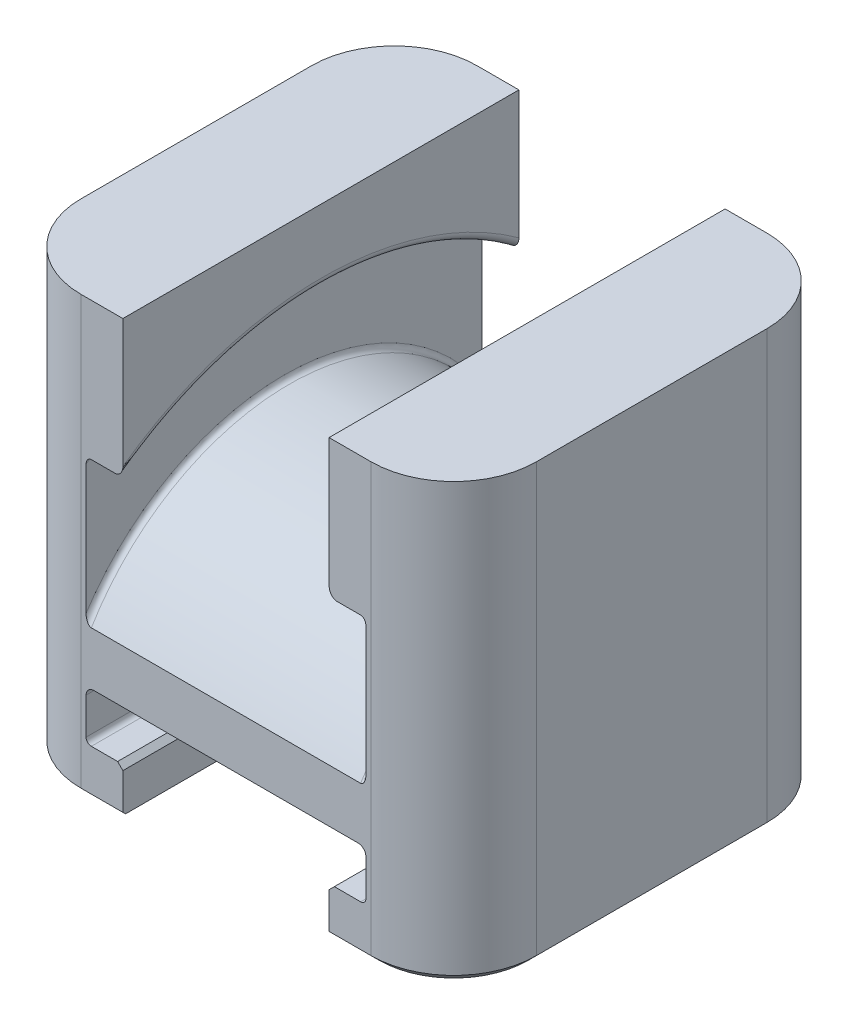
ISO-10303-21;
HEADER;
FILE_DESCRIPTION(('STEP AP214'),'2;1');
FILE_NAME('part.step','',(''),(''),'','','');
FILE_SCHEMA(('AUTOMOTIVE_DESIGN { 1 0 10303 214 1 1 1 1 }'));
ENDSEC;
DATA;
#1=APPLICATION_CONTEXT('core data for automotive mechanical design processes');
#2=APPLICATION_PROTOCOL_DEFINITION('international standard','automotive_design',2000,#1);
#3=PRODUCT_CONTEXT('',#1,'mechanical');
#4=PRODUCT('Part','Part','',(#3));
#5=PRODUCT_RELATED_PRODUCT_CATEGORY('part','',(#4));
#6=PRODUCT_DEFINITION_FORMATION('','',#4);
#7=PRODUCT_DEFINITION_CONTEXT('part definition',#1,'design');
#8=PRODUCT_DEFINITION('design','',#6,#7);
#9=PRODUCT_DEFINITION_SHAPE('','',#8);
#10=(LENGTH_UNIT() NAMED_UNIT(*) SI_UNIT(.MILLI.,.METRE.));
#11=(NAMED_UNIT(*) PLANE_ANGLE_UNIT() SI_UNIT($,.RADIAN.));
#12=(NAMED_UNIT(*) SI_UNIT($,.STERADIAN.) SOLID_ANGLE_UNIT());
#13=UNCERTAINTY_MEASURE_WITH_UNIT(LENGTH_MEASURE(1.E-05),#10,'distance_accuracy_value','');
#14=(GEOMETRIC_REPRESENTATION_CONTEXT(3) GLOBAL_UNCERTAINTY_ASSIGNED_CONTEXT((#13)) GLOBAL_UNIT_ASSIGNED_CONTEXT((#10,
#11,#12)) REPRESENTATION_CONTEXT('',''));
#15=CARTESIAN_POINT('',(0.,0.,0.));
#16=DIRECTION('',(0.,0.,1.));
#17=DIRECTION('',(1.,0.,0.));
#18=AXIS2_PLACEMENT_3D('',#15,#16,#17);
#19=CARTESIAN_POINT('',(21.9075,-3.175,19.05));
#20=DIRECTION('',(0.,1.,0.));
#21=DIRECTION('',(0.,0.,1.));
#22=AXIS2_PLACEMENT_3D('',#19,#20,#21);
#23=PLANE('',#22);
#24=CARTESIAN_POINT('',(13.9573,-3.175,11.0998));
#25=DIRECTION('',(0.,1.,0.));
#26=DIRECTION('',(0.,0.,1.));
#27=AXIS2_PLACEMENT_3D('',#24,#25,#26);
#28=CIRCLE('',#27,7.1882);
#29=CARTESIAN_POINT('',(21.1455,-3.175,11.0998));
#30=VERTEX_POINT('',#29);
#31=CARTESIAN_POINT('',(13.9573,-3.175,18.288));
#32=VERTEX_POINT('',#31);
#33=EDGE_CURVE('E648',#30,#32,#28,.F.);
#34=ORIENTED_EDGE('',*,*,#33,.T.);
#35=DIRECTION('',(-1.,0.,0.));
#36=VECTOR('',#35,1.);
#37=CARTESIAN_POINT('',(21.9075,-3.175,18.288));
#38=LINE('',#37,#36);
#39=CARTESIAN_POINT('',(10.4267,-3.175,18.288));
#40=VERTEX_POINT('',#39);
#41=EDGE_CURVE('E650',#32,#40,#38,.T.);
#42=ORIENTED_EDGE('',*,*,#41,.T.);
#43=DIRECTION('',(0.,0.,-1.));
#44=VECTOR('',#43,1.);
#45=CARTESIAN_POINT('',(10.4267,-3.175,19.05));
#46=LINE('',#45,#44);
#47=CARTESIAN_POINT('',(10.4267,-3.175,-18.288));
#48=VERTEX_POINT('',#47);
#49=EDGE_CURVE('E626',#40,#48,#46,.T.);
#50=ORIENTED_EDGE('',*,*,#49,.T.);
#51=DIRECTION('',(1.,0.,0.));
#52=VECTOR('',#51,1.);
#53=CARTESIAN_POINT('',(21.9075,-3.175,-18.288));
#54=LINE('',#53,#52);
#55=CARTESIAN_POINT('',(13.9573,-3.175,-18.288));
#56=VERTEX_POINT('',#55);
#57=EDGE_CURVE('E642',#48,#56,#54,.T.);
#58=ORIENTED_EDGE('',*,*,#57,.T.);
#59=CARTESIAN_POINT('',(13.9573,-3.175,-11.0998));
#60=DIRECTION('',(0.,1.,0.));
#61=DIRECTION('',(0.,0.,1.));
#62=AXIS2_PLACEMENT_3D('',#59,#60,#61);
#63=CIRCLE('',#62,7.1882);
#64=CARTESIAN_POINT('',(21.1455,-3.175,-11.0998));
#65=VERTEX_POINT('',#64);
#66=EDGE_CURVE('E644',#56,#65,#63,.F.);
#67=ORIENTED_EDGE('',*,*,#66,.T.);
#68=DIRECTION('',(0.,0.,1.));
#69=VECTOR('',#68,1.);
#70=CARTESIAN_POINT('',(21.1455,-3.175,11.0998));
#71=LINE('',#70,#69);
#72=EDGE_CURVE('E646',#65,#30,#71,.T.);
#73=ORIENTED_EDGE('',*,*,#72,.T.);
#74=EDGE_LOOP('',(#34,#42,#50,#58,#67,#73));
#75=FACE_BOUND('',#74,.T.);
#76=ADVANCED_FACE('F39',(#75),#23,.F.);
#77=CARTESIAN_POINT('',(21.9075,38.735,19.05));
#78=DIRECTION('',(0.,-1.,0.));
#79=DIRECTION('',(0.,0.,-1.));
#80=AXIS2_PLACEMENT_3D('',#77,#78,#79);
#81=PLANE('',#80);
#82=DIRECTION('',(0.,0.,1.));
#83=VECTOR('',#82,1.);
#84=CARTESIAN_POINT('',(-21.9075,38.735,19.05));
#85=LINE('',#84,#83);
#86=CARTESIAN_POINT('',(-21.9075,38.735,-11.0998));
#87=VERTEX_POINT('',#86);
#88=CARTESIAN_POINT('',(-21.9075,38.735,11.0998));
#89=VERTEX_POINT('',#88);
#90=EDGE_CURVE('E751',#87,#89,#85,.T.);
#91=ORIENTED_EDGE('',*,*,#90,.T.);
#92=CARTESIAN_POINT('',(-13.9573,38.735,11.0998));
#93=DIRECTION('',(0.,-1.,0.));
#94=DIRECTION('',(0.,0.,-1.));
#95=AXIS2_PLACEMENT_3D('',#92,#93,#94);
#96=CIRCLE('',#95,7.9502);
#97=CARTESIAN_POINT('',(-13.9573,38.735,19.05));
#98=VERTEX_POINT('',#97);
#99=EDGE_CURVE('E393',#89,#98,#96,.F.);
#100=ORIENTED_EDGE('',*,*,#99,.T.);
#101=DIRECTION('',(-1.,0.,0.));
#102=VECTOR('',#101,1.);
#103=CARTESIAN_POINT('',(21.9075,38.735,19.05));
#104=LINE('',#103,#102);
#105=CARTESIAN_POINT('',(-9.9187,38.735,19.05));
#106=VERTEX_POINT('',#105);
#107=EDGE_CURVE('E755',#106,#98,#104,.T.);
#108=ORIENTED_EDGE('',*,*,#107,.F.);
#109=DIRECTION('',(0.,0.,-1.));
#110=VECTOR('',#109,1.);
#111=CARTESIAN_POINT('',(-9.9187,38.735,19.05));
#112=LINE('',#111,#110);
#113=CARTESIAN_POINT('',(-9.9187,38.735,-19.05));
#114=VERTEX_POINT('',#113);
#115=EDGE_CURVE('E351',#106,#114,#112,.T.);
#116=ORIENTED_EDGE('',*,*,#115,.T.);
#117=DIRECTION('',(-1.,0.,0.));
#118=VECTOR('',#117,1.);
#119=CARTESIAN_POINT('',(21.9075,38.735,-19.05));
#120=LINE('',#119,#118);
#121=CARTESIAN_POINT('',(-13.9573,38.735,-19.05));
#122=VERTEX_POINT('',#121);
#123=EDGE_CURVE('E346',#114,#122,#120,.T.);
#124=ORIENTED_EDGE('',*,*,#123,.T.);
#125=CARTESIAN_POINT('',(-13.9573,38.735,-11.0998));
#126=DIRECTION('',(0.,-1.,0.));
#127=DIRECTION('',(0.,0.,-1.));
#128=AXIS2_PLACEMENT_3D('',#125,#126,#127);
#129=CIRCLE('',#128,7.9502);
#130=EDGE_CURVE('E391',#122,#87,#129,.F.);
#131=ORIENTED_EDGE('',*,*,#130,.T.);
#132=EDGE_LOOP('',(#91,#100,#108,#116,#124,#131));
#133=FACE_BOUND('',#132,.T.);
#134=ADVANCED_FACE('F497',(#133),#81,.F.);
#135=CARTESIAN_POINT('',(21.9075,38.735,19.05));
#136=DIRECTION('',(0.,0.,-1.));
#137=DIRECTION('',(-1.,0.,0.));
#138=AXIS2_PLACEMENT_3D('',#135,#136,#137);
#139=PLANE('',#138);
#140=DIRECTION('',(0.,1.,0.));
#141=VECTOR('',#140,1.);
#142=CARTESIAN_POINT('',(9.9187,1.5748,19.05));
#143=LINE('',#142,#141);
#144=CARTESIAN_POINT('',(9.9187,-2.41300000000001,19.05));
#145=VERTEX_POINT('',#144);
#146=CARTESIAN_POINT('',(9.9187,1.06680000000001,19.05));
#147=VERTEX_POINT('',#146);
#148=EDGE_CURVE('E794',#145,#147,#143,.T.);
#149=ORIENTED_EDGE('',*,*,#148,.F.);
#150=DIRECTION('',(1.,0.,0.));
#151=VECTOR('',#150,1.);
#152=CARTESIAN_POINT('',(21.9075,-2.41300000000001,19.05));
#153=LINE('',#152,#151);
#154=CARTESIAN_POINT('',(13.9573,-2.41300000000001,19.05));
#155=VERTEX_POINT('',#154);
#156=EDGE_CURVE('E663',#145,#155,#153,.T.);
#157=ORIENTED_EDGE('',*,*,#156,.T.);
#158=DIRECTION('',(0.,-1.,0.));
#159=VECTOR('',#158,1.);
#160=CARTESIAN_POINT('',(13.9573,38.735,19.05));
#161=LINE('',#160,#159);
#162=CARTESIAN_POINT('',(13.9573,38.735,19.05));
#163=VERTEX_POINT('',#162);
#164=EDGE_CURVE('E385',#155,#163,#161,.F.);
#165=ORIENTED_EDGE('',*,*,#164,.T.);
#166=CARTESIAN_POINT('',(9.9187,38.735,19.05));
#167=VERTEX_POINT('',#166);
#168=EDGE_CURVE('E757',#163,#167,#104,.T.);
#169=ORIENTED_EDGE('',*,*,#168,.T.);
#170=DIRECTION('',(0.,-1.,0.));
#171=VECTOR('',#170,1.);
#172=CARTESIAN_POINT('',(9.9187,38.735,19.05));
#173=LINE('',#172,#171);
#174=CARTESIAN_POINT('',(9.9187,26.4089652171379,19.05));
#175=VERTEX_POINT('',#174);
#176=EDGE_CURVE('E335',#167,#175,#173,.T.);
#177=ORIENTED_EDGE('',*,*,#176,.T.);
#178=CARTESIAN_POINT('',(9.9187,26.4089652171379,19.05));
#179=CARTESIAN_POINT('',(9.91872387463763,26.3446170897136,19.05));
#180=CARTESIAN_POINT('',(9.92406687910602,26.2801907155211,19.05));
#181=CARTESIAN_POINT('',(9.94562096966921,26.152499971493,19.05));
#182=CARTESIAN_POINT('',(9.96194519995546,26.0892548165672,19.05));
#183=CARTESIAN_POINT('',(10.0054207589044,25.9674501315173,19.05));
#184=CARTESIAN_POINT('',(10.0324326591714,25.9088414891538,19.05));
#185=CARTESIAN_POINT('',(10.0973723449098,25.7982314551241,19.05));
#186=CARTESIAN_POINT('',(10.1352441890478,25.7461981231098,19.05));
#187=CARTESIAN_POINT('',(10.2066712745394,25.6682629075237,19.05));
#188=CARTESIAN_POINT('',(10.2371796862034,25.6395517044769,19.05));
#189=CARTESIAN_POINT('',(10.3025030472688,25.5874382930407,19.05));
#190=CARTESIAN_POINT('',(10.337318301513,25.5640364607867,19.05));
#191=CARTESIAN_POINT('',(10.4109228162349,25.5236582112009,19.05));
#192=CARTESIAN_POINT('',(10.4497440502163,25.5067395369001,19.05));
#193=CARTESIAN_POINT('',(10.5299195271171,25.4808656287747,19.05));
#194=CARTESIAN_POINT('',(10.571266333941,25.471888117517,19.05));
#195=CARTESIAN_POINT('',(10.6242584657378,25.4659793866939,19.05));
#196=CARTESIAN_POINT('',(10.6355333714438,25.4650391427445,19.05));
#197=CARTESIAN_POINT('',(10.6581036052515,25.4637862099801,19.05));
#198=CARTESIAN_POINT('',(10.6693988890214,25.4634727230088,19.05));
#199=CARTESIAN_POINT('',(10.6807,25.4634714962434,19.05));
#200=B_SPLINE_CURVE_WITH_KNOTS('',3,(#178,#179,#180,#181,#182,#183,#184,#185,#186,#187,#188,
#189,#190,#191,#192,#193,#194,#195,#196,#197,#198,#199),.UNSPECIFIED.,.F.,.F.,(4,2,2,2,2,2,2,2,
2,2,4),(0.,0.192959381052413,0.387937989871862,0.580452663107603,0.771992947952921,
0.897203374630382,1.02242266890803,1.14873266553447,1.27468718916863,1.30861780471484,
1.34250518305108),.UNSPECIFIED.);
#201=CARTESIAN_POINT('',(10.6807,25.4634714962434,19.05));
#202=VERTEX_POINT('',#201);
#203=EDGE_CURVE('E521',#175,#202,#200,.T.);
#204=ORIENTED_EDGE('',*,*,#203,.T.);
#205=DIRECTION('',(-1.,0.,0.));
#206=VECTOR('',#205,1.);
#207=CARTESIAN_POINT('',(-18.4382991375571,25.4634714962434,19.05));
#208=LINE('',#207,#206);
#209=CARTESIAN_POINT('',(12.954,25.4634714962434,19.05));
#210=VERTEX_POINT('',#209);
#211=EDGE_CURVE('E577',#202,#210,#208,.F.);
#212=ORIENTED_EDGE('',*,*,#211,.T.);
#213=CARTESIAN_POINT('',(12.954,25.4634714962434,19.05));
#214=CARTESIAN_POINT('',(12.9785489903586,25.4635165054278,19.05));
#215=CARTESIAN_POINT('',(13.0030584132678,25.4612524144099,19.05));
#216=CARTESIAN_POINT('',(13.0511626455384,25.4524806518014,19.05));
#217=CARTESIAN_POINT('',(13.0747619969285,25.4459980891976,19.05));
#218=CARTESIAN_POINT('',(13.1204815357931,25.4291690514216,19.05));
#219=CARTESIAN_POINT('',(13.1426039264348,25.4188284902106,19.05));
#220=CARTESIAN_POINT('',(13.1849762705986,25.3948150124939,19.05));
#221=CARTESIAN_POINT('',(13.2052237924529,25.3811378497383,19.05));
#222=CARTESIAN_POINT('',(13.244864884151,25.3499717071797,19.05));
#223=CARTESIAN_POINT('',(13.2641010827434,25.3322837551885,19.05));
#224=CARTESIAN_POINT('',(13.2999007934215,25.2944013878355,19.05));
#225=CARTESIAN_POINT('',(13.3164636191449,25.2742063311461,19.05));
#226=CARTESIAN_POINT('',(13.3497536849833,25.2278524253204,19.05));
#227=CARTESIAN_POINT('',(13.3659165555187,25.2012888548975,19.05));
#228=CARTESIAN_POINT('',(13.394428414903,25.146180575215,19.05));
#229=CARTESIAN_POINT('',(13.4067733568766,25.1176338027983,19.05));
#230=CARTESIAN_POINT('',(13.4298594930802,25.0532259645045,19.05));
#231=CARTESIAN_POINT('',(13.4397570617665,25.0170625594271,19.05));
#232=CARTESIAN_POINT('',(13.4542468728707,24.9437348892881,19.05));
#233=CARTESIAN_POINT('',(13.4588446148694,24.9065717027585,19.05));
#234=CARTESIAN_POINT('',(13.4616149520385,24.8549162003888,19.05));
#235=CARTESIAN_POINT('',(13.4619994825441,24.8405210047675,19.05));
#236=CARTESIAN_POINT('',(13.462,24.8261320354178,19.05));
#237=B_SPLINE_CURVE_WITH_KNOTS('',3,(#213,#214,#215,#216,#217,#218,#219,#220,#221,#222,#223,
#224,#225,#226,#227,#228,#229,#230,#231,#232,#233,#234,#235,#236),.UNSPECIFIED.,.F.,.F.,(4,2,2,
2,2,2,2,2,2,2,2,4),(0.,0.0734802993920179,0.146527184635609,0.219462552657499,0.292491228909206,
0.370599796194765,0.448728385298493,0.54167193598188,0.634713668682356,0.746773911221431,
0.858717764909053,0.9018956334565),.UNSPECIFIED.);
#238=CARTESIAN_POINT('',(13.462,24.8261320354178,19.05));
#239=VERTEX_POINT('',#238);
#240=EDGE_CURVE('E446',#210,#239,#237,.T.);
#241=ORIENTED_EDGE('',*,*,#240,.T.);
#242=DIRECTION('',(0.,-1.,0.));
#243=VECTOR('',#242,1.);
#244=CARTESIAN_POINT('',(13.462,38.735,19.05));
#245=LINE('',#244,#243);
#246=CARTESIAN_POINT('',(13.462,12.4051114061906,19.05));
#247=VERTEX_POINT('',#246);
#248=EDGE_CURVE('E743',#239,#247,#245,.T.);
#249=ORIENTED_EDGE('',*,*,#248,.T.);
#250=CARTESIAN_POINT('',(13.462,12.4051114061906,19.05));
#251=CARTESIAN_POINT('',(13.4619790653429,12.3622159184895,19.05));
#252=CARTESIAN_POINT('',(13.4603808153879,12.3193136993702,19.05));
#253=CARTESIAN_POINT('',(13.4539452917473,12.2336494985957,19.05));
#254=CARTESIAN_POINT('',(13.4491001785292,12.1908881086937,19.05));
#255=CARTESIAN_POINT('',(13.4360647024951,12.1057313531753,19.05));
#256=CARTESIAN_POINT('',(13.427863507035,12.0633376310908,19.05));
#257=CARTESIAN_POINT('',(13.4078752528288,11.9794411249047,19.05));
#258=CARTESIAN_POINT('',(13.3960925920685,11.93793731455,19.05));
#259=CARTESIAN_POINT('',(13.3717569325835,11.8659114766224,19.05));
#260=CARTESIAN_POINT('',(13.3600405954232,11.8351074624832,19.05));
#261=CARTESIAN_POINT('',(13.3339429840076,11.7746172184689,19.05));
#262=CARTESIAN_POINT('',(13.3195607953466,11.7449313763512,19.05));
#263=CARTESIAN_POINT('',(13.2875893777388,11.6870273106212,19.05));
#264=CARTESIAN_POINT('',(13.2699770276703,11.6588216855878,19.05));
#265=CARTESIAN_POINT('',(13.2310280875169,11.6051028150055,19.05));
#266=CARTESIAN_POINT('',(13.2097009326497,11.5795830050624,19.05));
#267=CARTESIAN_POINT('',(13.1725830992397,11.542817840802,19.05));
#268=CARTESIAN_POINT('',(13.1582607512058,11.5300972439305,19.05));
#269=CARTESIAN_POINT('',(13.1280239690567,11.506653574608,19.05));
#270=CARTESIAN_POINT('',(13.1121089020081,11.4959313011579,19.05));
#271=CARTESIAN_POINT('',(13.0784943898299,11.4770640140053,19.05));
#272=CARTESIAN_POINT('',(13.0607732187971,11.4689568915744,19.05));
#273=CARTESIAN_POINT('',(13.0240979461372,11.4563984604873,19.05));
#274=CARTESIAN_POINT('',(13.0051492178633,11.4519322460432,19.05));
#275=CARTESIAN_POINT('',(12.9806723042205,11.4489304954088,19.05));
#276=CARTESIAN_POINT('',(12.9753501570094,11.4484418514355,19.05));
#277=CARTESIAN_POINT('',(12.9646862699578,11.4477895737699,19.05));
#278=CARTESIAN_POINT('',(12.9593445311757,11.4476259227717,19.05));
#279=CARTESIAN_POINT('',(12.954,11.4476252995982,19.05));
#280=B_SPLINE_CURVE_WITH_KNOTS('',3,(#250,#251,#252,#253,#254,#255,#256,#257,#258,#259,#260,
#261,#262,#263,#264,#265,#266,#267,#268,#269,#270,#271,#272,#273,#274,#275,#276,#277,#278,#279),
.UNSPECIFIED.,.F.,.F.,(4,2,2,2,2,2,2,2,2,2,2,2,2,2,4),(0.,0.128668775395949,0.257649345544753,
0.387049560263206,0.5162915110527,0.61506064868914,0.713863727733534,0.813403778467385,
0.91269459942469,0.970031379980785,1.02739103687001,1.08554790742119,1.14346547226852,
1.1594919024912,1.17551747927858),.UNSPECIFIED.);
#281=CARTESIAN_POINT('',(12.954,11.4476252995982,19.05));
#282=VERTEX_POINT('',#281);
#283=EDGE_CURVE('E480',#247,#282,#280,.T.);
#284=ORIENTED_EDGE('',*,*,#283,.T.);
#285=DIRECTION('',(-1.,0.,0.));
#286=VECTOR('',#285,1.);
#287=CARTESIAN_POINT('',(-18.4382991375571,11.4476252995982,19.05));
#288=LINE('',#287,#286);
#289=CARTESIAN_POINT('',(-12.954,11.4476252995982,19.05));
#290=VERTEX_POINT('',#289);
#291=EDGE_CURVE('E748',#282,#290,#288,.T.);
#292=ORIENTED_EDGE('',*,*,#291,.T.);
#293=CARTESIAN_POINT('',(-12.954,11.4476252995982,19.05));
#294=CARTESIAN_POINT('',(-12.9698484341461,11.4475862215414,19.05));
#295=CARTESIAN_POINT('',(-12.9856472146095,11.4490631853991,19.05));
#296=CARTESIAN_POINT('',(-13.0165970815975,11.4546906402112,19.05));
#297=CARTESIAN_POINT('',(-13.031753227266,11.458812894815,19.05));
#298=CARTESIAN_POINT('',(-13.0646412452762,11.4706137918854,19.05));
#299=CARTESIAN_POINT('',(-13.082153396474,11.4788962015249,19.05));
#300=CARTESIAN_POINT('',(-13.1156518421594,11.4981937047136,19.05));
#301=CARTESIAN_POINT('',(-13.131631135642,11.5092205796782,19.05));
#302=CARTESIAN_POINT('',(-13.1701106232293,11.5397183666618,19.05));
#303=CARTESIAN_POINT('',(-13.1915232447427,11.5605498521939,19.05));
#304=CARTESIAN_POINT('',(-13.2309773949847,11.6051466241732,19.05));
#305=CARTESIAN_POINT('',(-13.2490122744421,11.6289175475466,19.05));
#306=CARTESIAN_POINT('',(-13.2953307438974,11.6978336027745,19.05));
#307=CARTESIAN_POINT('',(-13.3204920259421,11.7450615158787,19.05));
#308=CARTESIAN_POINT('',(-13.3638743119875,11.8426993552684,19.05));
#309=CARTESIAN_POINT('',(-13.3820610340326,11.8931236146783,19.05));
#310=CARTESIAN_POINT('',(-13.4084812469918,11.9820188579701,19.05));
#311=CARTESIAN_POINT('',(-13.4180755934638,12.0200952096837,19.05));
#312=CARTESIAN_POINT('',(-13.4343644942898,12.0968846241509,19.05));
#313=CARTESIAN_POINT('',(-13.441057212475,12.1355980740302,19.05));
#314=CARTESIAN_POINT('',(-13.4516037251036,12.2127222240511,19.05));
#315=CARTESIAN_POINT('',(-13.455504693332,12.2511265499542,19.05));
#316=CARTESIAN_POINT('',(-13.4606943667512,12.3280587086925,19.05));
#317=CARTESIAN_POINT('',(-13.4619866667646,12.3665862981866,19.05));
#318=CARTESIAN_POINT('',(-13.462,12.4051114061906,19.05));
#319=B_SPLINE_CURVE_WITH_KNOTS('',3,(#293,#294,#295,#296,#297,#298,#299,#300,#301,#302,#303,
#304,#305,#306,#307,#308,#309,#310,#311,#312,#313,#314,#315,#316,#317,#318),.UNSPECIFIED.,.F.,
.F.,(4,2,2,2,2,2,2,2,2,2,2,2,4),(0.,0.0473962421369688,0.0942947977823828,0.152089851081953,
0.210137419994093,0.299254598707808,0.388545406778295,0.548195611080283,0.708620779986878,
0.826304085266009,0.944061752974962,1.05977934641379,1.17533736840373),.UNSPECIFIED.);
#320=CARTESIAN_POINT('',(-13.462,12.4051114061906,19.05));
#321=VERTEX_POINT('',#320);
#322=EDGE_CURVE('E507',#290,#321,#319,.T.);
#323=ORIENTED_EDGE('',*,*,#322,.T.);
#324=DIRECTION('',(0.,1.,0.));
#325=VECTOR('',#324,1.);
#326=CARTESIAN_POINT('',(-13.462,38.735,19.05));
#327=LINE('',#326,#325);
#328=CARTESIAN_POINT('',(-13.462,24.8261320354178,19.05));
#329=VERTEX_POINT('',#328);
#330=EDGE_CURVE('E576',#321,#329,#327,.T.);
#331=ORIENTED_EDGE('',*,*,#330,.T.);
#332=CARTESIAN_POINT('',(-13.462,24.8261320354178,19.05));
#333=CARTESIAN_POINT('',(-13.4619858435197,24.8690502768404,19.05));
#334=CARTESIAN_POINT('',(-13.4585724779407,24.912048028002,19.05));
#335=CARTESIAN_POINT('',(-13.4447280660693,24.9971603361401,19.05));
#336=CARTESIAN_POINT('',(-13.4342539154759,25.0392678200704,19.05));
#337=CARTESIAN_POINT('',(-13.408308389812,25.1144898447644,19.05));
#338=CARTESIAN_POINT('',(-13.3938982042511,25.1479687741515,19.05));
#339=CARTESIAN_POINT('',(-13.3598449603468,25.2120977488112,19.05));
#340=CARTESIAN_POINT('',(-13.3402153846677,25.242754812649,19.05));
#341=CARTESIAN_POINT('',(-13.3000254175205,25.2944448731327,19.05));
#342=CARTESIAN_POINT('',(-13.2803838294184,25.3161912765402,19.05));
#343=CARTESIAN_POINT('',(-13.2378022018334,25.3562011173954,19.05));
#344=CARTESIAN_POINT('',(-13.214864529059,25.3744670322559,19.05));
#345=CARTESIAN_POINT('',(-13.1696947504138,25.4041679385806,19.05));
#346=CARTESIAN_POINT('',(-13.1478656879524,25.416214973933,19.05));
#347=CARTESIAN_POINT('',(-13.1025139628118,25.4364916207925,19.05));
#348=CARTESIAN_POINT('',(-13.0789941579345,25.444727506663,19.05));
#349=CARTESIAN_POINT('',(-13.038471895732,25.4549909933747,19.05));
#350=CARTESIAN_POINT('',(-13.021751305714,25.4581571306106,19.05));
#351=CARTESIAN_POINT('',(-12.9880250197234,25.4624033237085,19.05));
#352=CARTESIAN_POINT('',(-12.9710189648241,25.4634805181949,19.05));
#353=CARTESIAN_POINT('',(-12.954,25.4634714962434,19.05));
#354=B_SPLINE_CURVE_WITH_KNOTS('',3,(#332,#333,#334,#335,#336,#337,#338,#339,#340,#341,#342,
#343,#344,#345,#346,#347,#348,#349,#350,#351,#352,#353),.UNSPECIFIED.,.F.,.F.,(4,2,2,2,2,2,2,2,
2,2,4),(0.,0.128756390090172,0.258306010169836,0.367228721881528,0.475872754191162,
0.563446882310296,0.650958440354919,0.725446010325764,0.799810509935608,0.850740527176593,
0.901740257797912),.UNSPECIFIED.);
#355=CARTESIAN_POINT('',(-12.954,25.4634714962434,19.05));
#356=VERTEX_POINT('',#355);
#357=EDGE_CURVE('E514',#329,#356,#354,.T.);
#358=ORIENTED_EDGE('',*,*,#357,.T.);
#359=DIRECTION('',(-1.,0.,0.));
#360=VECTOR('',#359,1.);
#361=CARTESIAN_POINT('',(-18.4382991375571,25.4634714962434,19.05));
#362=LINE('',#361,#360);
#363=CARTESIAN_POINT('',(-10.6807,25.4634714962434,19.05));
#364=VERTEX_POINT('',#363);
#365=EDGE_CURVE('E568',#356,#364,#362,.F.);
#366=ORIENTED_EDGE('',*,*,#365,.T.);
#367=CARTESIAN_POINT('',(-10.6807,25.4634714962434,19.05));
#368=CARTESIAN_POINT('',(-10.662255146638,25.4634693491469,19.05));
#369=CARTESIAN_POINT('',(-10.6438205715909,25.4643085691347,19.05));
#370=CARTESIAN_POINT('',(-10.6071106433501,25.4676410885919,19.05));
#371=CARTESIAN_POINT('',(-10.5888352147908,25.4701335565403,19.05));
#372=CARTESIAN_POINT('',(-10.534673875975,25.4800042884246,19.05));
#373=CARTESIAN_POINT('',(-10.4991990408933,25.4897767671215,19.05));
#374=CARTESIAN_POINT('',(-10.4304905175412,25.5151058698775,19.05));
#375=CARTESIAN_POINT('',(-10.397253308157,25.5306531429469,19.05));
#376=CARTESIAN_POINT('',(-10.33358068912,25.5667469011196,19.05));
#377=CARTESIAN_POINT('',(-10.3031490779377,25.5873000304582,19.05));
#378=CARTESIAN_POINT('',(-10.2434822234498,25.6341757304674,19.05));
#379=CARTESIAN_POINT('',(-10.214491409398,25.6608074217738,19.05));
#380=CARTESIAN_POINT('',(-10.1605289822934,25.7178443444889,19.05));
#381=CARTESIAN_POINT('',(-10.1355583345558,25.7482504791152,19.05));
#382=CARTESIAN_POINT('',(-10.0853439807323,25.8180852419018,19.05));
#383=CARTESIAN_POINT('',(-10.0609562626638,25.8581287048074,19.05));
#384=CARTESIAN_POINT('',(-10.0179753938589,25.9412303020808,19.05));
#385=CARTESIAN_POINT('',(-9.9993887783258,25.9842917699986,19.05));
#386=CARTESIAN_POINT('',(-9.96489168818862,26.0810696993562,19.05));
#387=CARTESIAN_POINT('',(-9.95021201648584,26.1352251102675,19.05));
#388=CARTESIAN_POINT('',(-9.92898099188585,26.2450307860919,19.05));
#389=CARTESIAN_POINT('',(-9.92241879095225,26.3006789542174,19.05));
#390=CARTESIAN_POINT('',(-9.91909668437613,26.3739573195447,19.05));
#391=CARTESIAN_POINT('',(-9.9187002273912,26.3914645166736,19.05));
#392=CARTESIAN_POINT('',(-9.9187,26.4089652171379,19.05));
#393=B_SPLINE_CURVE_WITH_KNOTS('',3,(#367,#368,#369,#370,#371,#372,#373,#374,#375,#376,#377,
#378,#379,#380,#381,#382,#383,#384,#385,#386,#387,#388,#389,#390,#391,#392),.UNSPECIFIED.,.F.,
.F.,(4,2,2,2,2,2,2,2,2,2,2,2,4),(0.,0.0552957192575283,0.110563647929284,0.220348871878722,
0.329957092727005,0.439711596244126,0.557378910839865,0.675074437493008,0.815214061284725,
0.955510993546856,1.12319690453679,1.2906584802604,1.34317363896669),.UNSPECIFIED.);
#394=CARTESIAN_POINT('',(-9.9187,26.4089652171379,19.05));
#395=VERTEX_POINT('',#394);
#396=EDGE_CURVE('E528',#364,#395,#393,.T.);
#397=ORIENTED_EDGE('',*,*,#396,.T.);
#398=DIRECTION('',(0.,1.,0.));
#399=VECTOR('',#398,1.);
#400=CARTESIAN_POINT('',(-9.9187,38.735,19.05));
#401=LINE('',#400,#399);
#402=EDGE_CURVE('E741',#395,#106,#401,.T.);
#403=ORIENTED_EDGE('',*,*,#402,.T.);
#404=ORIENTED_EDGE('',*,*,#107,.T.);
#405=DIRECTION('',(0.,-1.,0.));
#406=VECTOR('',#405,1.);
#407=CARTESIAN_POINT('',(-13.9573,38.735,19.05));
#408=LINE('',#407,#406);
#409=CARTESIAN_POINT('',(-13.9573,-2.41299999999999,19.05));
#410=VERTEX_POINT('',#409);
#411=EDGE_CURVE('E382',#98,#410,#408,.T.);
#412=ORIENTED_EDGE('',*,*,#411,.T.);
#413=DIRECTION('',(1.,0.,0.));
#414=VECTOR('',#413,1.);
#415=CARTESIAN_POINT('',(21.9075,-2.41299999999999,19.05));
#416=LINE('',#415,#414);
#417=CARTESIAN_POINT('',(-9.9187,-2.41299999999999,19.05));
#418=VERTEX_POINT('',#417);
#419=EDGE_CURVE('E661',#410,#418,#416,.T.);
#420=ORIENTED_EDGE('',*,*,#419,.T.);
#421=DIRECTION('',(0.,-1.,0.));
#422=VECTOR('',#421,1.);
#423=CARTESIAN_POINT('',(-9.9187,-3.175,19.05));
#424=LINE('',#423,#422);
#425=CARTESIAN_POINT('',(-9.9187,1.06680000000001,19.05));
#426=VERTEX_POINT('',#425);
#427=EDGE_CURVE('E789',#426,#418,#424,.T.);
#428=ORIENTED_EDGE('',*,*,#427,.F.);
#429=DIRECTION('',(0.707106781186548,-0.707106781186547,0.));
#430=VECTOR('',#429,1.);
#431=CARTESIAN_POINT('',(-9.9187,1.06680000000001,19.05));
#432=LINE('',#431,#430);
#433=CARTESIAN_POINT('',(-10.4267,1.5748,19.05));
#434=VERTEX_POINT('',#433);
#435=EDGE_CURVE('E601',#426,#434,#432,.F.);
#436=ORIENTED_EDGE('',*,*,#435,.T.);
#437=DIRECTION('',(1.,0.,0.));
#438=VECTOR('',#437,1.);
#439=CARTESIAN_POINT('',(-9.9187,1.5748,19.05));
#440=LINE('',#439,#438);
#441=CARTESIAN_POINT('',(-12.954,1.5748,19.05));
#442=VERTEX_POINT('',#441);
#443=EDGE_CURVE('E795',#442,#434,#440,.T.);
#444=ORIENTED_EDGE('',*,*,#443,.F.);
#445=CARTESIAN_POINT('',(-12.954,2.0828,19.05));
#446=DIRECTION('',(0.,0.,-1.));
#447=DIRECTION('',(-1.,0.,0.));
#448=AXIS2_PLACEMENT_3D('',#445,#446,#447);
#449=CIRCLE('',#448,0.508);
#450=CARTESIAN_POINT('',(-13.462,2.0828,19.05));
#451=VERTEX_POINT('',#450);
#452=EDGE_CURVE('E412',#442,#451,#449,.T.);
#453=ORIENTED_EDGE('',*,*,#452,.T.);
#454=DIRECTION('',(0.,-1.,0.));
#455=VECTOR('',#454,1.);
#456=CARTESIAN_POINT('',(-13.462,1.5748,19.05));
#457=LINE('',#456,#455);
#458=CARTESIAN_POINT('',(-13.462,5.588,19.05));
#459=VERTEX_POINT('',#458);
#460=EDGE_CURVE('E694',#459,#451,#457,.T.);
#461=ORIENTED_EDGE('',*,*,#460,.F.);
#462=CARTESIAN_POINT('',(-12.7,5.588,19.05));
#463=DIRECTION('',(0.,0.,-1.));
#464=DIRECTION('',(-1.,0.,0.));
#465=AXIS2_PLACEMENT_3D('',#462,#463,#464);
#466=CIRCLE('',#465,0.762);
#467=CARTESIAN_POINT('',(-12.7,6.35,19.05));
#468=VERTEX_POINT('',#467);
#469=EDGE_CURVE('E588',#459,#468,#466,.T.);
#470=ORIENTED_EDGE('',*,*,#469,.T.);
#471=DIRECTION('',(-1.,0.,0.));
#472=VECTOR('',#471,1.);
#473=CARTESIAN_POINT('',(-13.462,6.35,19.05));
#474=LINE('',#473,#472);
#475=CARTESIAN_POINT('',(12.7,6.35,19.05));
#476=VERTEX_POINT('',#475);
#477=EDGE_CURVE('E807',#476,#468,#474,.T.);
#478=ORIENTED_EDGE('',*,*,#477,.F.);
#479=CARTESIAN_POINT('',(12.7,5.588,19.05));
#480=DIRECTION('',(0.,0.,-1.));
#481=DIRECTION('',(-1.,0.,0.));
#482=AXIS2_PLACEMENT_3D('',#479,#480,#481);
#483=CIRCLE('',#482,0.762);
#484=CARTESIAN_POINT('',(13.462,5.588,19.05));
#485=VERTEX_POINT('',#484);
#486=EDGE_CURVE('E594',#476,#485,#483,.T.);
#487=ORIENTED_EDGE('',*,*,#486,.T.);
#488=DIRECTION('',(0.,1.,0.));
#489=VECTOR('',#488,1.);
#490=CARTESIAN_POINT('',(13.462,6.35,19.05));
#491=LINE('',#490,#489);
#492=CARTESIAN_POINT('',(13.462,2.08280000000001,19.05));
#493=VERTEX_POINT('',#492);
#494=EDGE_CURVE('E804',#493,#485,#491,.T.);
#495=ORIENTED_EDGE('',*,*,#494,.F.);
#496=CARTESIAN_POINT('',(12.954,2.0828,19.05));
#497=DIRECTION('',(0.,0.,-1.));
#498=DIRECTION('',(-1.,0.,0.));
#499=AXIS2_PLACEMENT_3D('',#496,#497,#498);
#500=CIRCLE('',#499,0.508);
#501=CARTESIAN_POINT('',(12.954,1.5748,19.05));
#502=VERTEX_POINT('',#501);
#503=EDGE_CURVE('E407',#493,#502,#500,.T.);
#504=ORIENTED_EDGE('',*,*,#503,.T.);
#505=DIRECTION('',(1.,0.,0.));
#506=VECTOR('',#505,1.);
#507=CARTESIAN_POINT('',(13.462,1.5748,19.05));
#508=LINE('',#507,#506);
#509=CARTESIAN_POINT('',(10.4267,1.5748,19.05));
#510=VERTEX_POINT('',#509);
#511=EDGE_CURVE('E797',#510,#502,#508,.T.);
#512=ORIENTED_EDGE('',*,*,#511,.F.);
#513=DIRECTION('',(0.707106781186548,0.707106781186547,0.));
#514=VECTOR('',#513,1.);
#515=CARTESIAN_POINT('',(10.4267,1.5748,19.05));
#516=LINE('',#515,#514);
#517=EDGE_CURVE('E603',#510,#147,#516,.F.);
#518=ORIENTED_EDGE('',*,*,#517,.T.);
#519=EDGE_LOOP('',(#149,#157,#165,#169,#177,#204,#212,#241,#249,#284,#292,#323,#331,#358,#366,
#397,#403,#404,#412,#420,#428,#436,#444,#453,#461,#470,#478,#487,#495,#504,#512,#518));
#520=FACE_BOUND('',#519,.T.);
#521=ADVANCED_FACE('F492',(#520),#139,.F.);
#522=DIRECTION('',(0.,0.,1.));
#523=VECTOR('',#522,1.);
#524=CARTESIAN_POINT('',(-10.4267,-3.175,19.05));
#525=LINE('',#524,#523);
#526=CARTESIAN_POINT('',(-10.4267,-3.175,-18.288));
#527=VERTEX_POINT('',#526);
#528=CARTESIAN_POINT('',(-10.4267,-3.175,18.288));
#529=VERTEX_POINT('',#528);
#530=EDGE_CURVE('E618',#527,#529,#525,.T.);
#531=ORIENTED_EDGE('',*,*,#530,.T.);
#532=DIRECTION('',(-1.,0.,0.));
#533=VECTOR('',#532,1.);
#534=CARTESIAN_POINT('',(21.9075,-3.175,18.288));
#535=LINE('',#534,#533);
#536=CARTESIAN_POINT('',(-13.9573,-3.175,18.288));
#537=VERTEX_POINT('',#536);
#538=EDGE_CURVE('E638',#529,#537,#535,.T.);
#539=ORIENTED_EDGE('',*,*,#538,.T.);
#540=CARTESIAN_POINT('',(-13.9573,-3.175,11.0998));
#541=DIRECTION('',(0.,1.,0.));
#542=DIRECTION('',(0.,0.,1.));
#543=AXIS2_PLACEMENT_3D('',#540,#541,#542);
#544=CIRCLE('',#543,7.18819999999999);
#545=CARTESIAN_POINT('',(-21.1455,-3.175,11.0998));
#546=VERTEX_POINT('',#545);
#547=EDGE_CURVE('E635',#537,#546,#544,.F.);
#548=ORIENTED_EDGE('',*,*,#547,.T.);
#549=DIRECTION('',(0.,0.,-1.));
#550=VECTOR('',#549,1.);
#551=CARTESIAN_POINT('',(-21.1455,-3.175,19.05));
#552=LINE('',#551,#550);
#553=CARTESIAN_POINT('',(-21.1455,-3.175,-11.0998));
#554=VERTEX_POINT('',#553);
#555=EDGE_CURVE('E633',#546,#554,#552,.T.);
#556=ORIENTED_EDGE('',*,*,#555,.T.);
#557=CARTESIAN_POINT('',(-13.9573,-3.175,-11.0998));
#558=DIRECTION('',(0.,1.,0.));
#559=DIRECTION('',(0.,0.,1.));
#560=AXIS2_PLACEMENT_3D('',#557,#558,#559);
#561=CIRCLE('',#560,7.18819999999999);
#562=CARTESIAN_POINT('',(-13.9573,-3.175,-18.288));
#563=VERTEX_POINT('',#562);
#564=EDGE_CURVE('E629',#554,#563,#561,.F.);
#565=ORIENTED_EDGE('',*,*,#564,.T.);
#566=DIRECTION('',(1.,0.,0.));
#567=VECTOR('',#566,1.);
#568=CARTESIAN_POINT('',(21.9075,-3.175,-18.288));
#569=LINE('',#568,#567);
#570=EDGE_CURVE('E631',#563,#527,#569,.T.);
#571=ORIENTED_EDGE('',*,*,#570,.T.);
#572=EDGE_LOOP('',(#531,#539,#548,#556,#565,#571));
#573=FACE_BOUND('',#572,.T.);
#574=ADVANCED_FACE('F496',(#573),#23,.F.);
#575=CARTESIAN_POINT('',(21.9075,38.735,-19.05));
#576=DIRECTION('',(0.,0.,1.));
#577=DIRECTION('',(1.,0.,0.));
#578=AXIS2_PLACEMENT_3D('',#575,#576,#577);
#579=PLANE('',#578);
#580=DIRECTION('',(0.,1.,0.));
#581=VECTOR('',#580,1.);
#582=CARTESIAN_POINT('',(13.9573,-3.175,-19.05));
#583=LINE('',#582,#581);
#584=CARTESIAN_POINT('',(13.9573,38.735,-19.05));
#585=VERTEX_POINT('',#584);
#586=CARTESIAN_POINT('',(13.9573,-2.41300000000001,-19.05));
#587=VERTEX_POINT('',#586);
#588=EDGE_CURVE('E380',#585,#587,#583,.F.);
#589=ORIENTED_EDGE('',*,*,#588,.T.);
#590=DIRECTION('',(-1.,0.,0.));
#591=VECTOR('',#590,1.);
#592=CARTESIAN_POINT('',(21.9075,-2.41300000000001,-19.05));
#593=LINE('',#592,#591);
#594=CARTESIAN_POINT('',(9.9187,-2.41300000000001,-19.05));
#595=VERTEX_POINT('',#594);
#596=EDGE_CURVE('E673',#587,#595,#593,.T.);
#597=ORIENTED_EDGE('',*,*,#596,.T.);
#598=DIRECTION('',(0.,1.,0.));
#599=VECTOR('',#598,1.);
#600=CARTESIAN_POINT('',(9.9187,1.5748,-19.05));
#601=LINE('',#600,#599);
#602=CARTESIAN_POINT('',(9.9187,1.06680000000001,-19.05));
#603=VERTEX_POINT('',#602);
#604=EDGE_CURVE('E718',#595,#603,#601,.T.);
#605=ORIENTED_EDGE('',*,*,#604,.T.);
#606=DIRECTION('',(-0.707106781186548,-0.707106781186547,0.));
#607=VECTOR('',#606,1.);
#608=CARTESIAN_POINT('',(10.4267,1.5748,-19.05));
#609=LINE('',#608,#607);
#610=CARTESIAN_POINT('',(10.4267,1.5748,-19.05));
#611=VERTEX_POINT('',#610);
#612=EDGE_CURVE('E611',#603,#611,#609,.F.);
#613=ORIENTED_EDGE('',*,*,#612,.T.);
#614=DIRECTION('',(1.,0.,0.));
#615=VECTOR('',#614,1.);
#616=CARTESIAN_POINT('',(13.462,1.5748,-19.05));
#617=LINE('',#616,#615);
#618=CARTESIAN_POINT('',(12.954,1.5748,-19.05));
#619=VERTEX_POINT('',#618);
#620=EDGE_CURVE('E724',#611,#619,#617,.T.);
#621=ORIENTED_EDGE('',*,*,#620,.T.);
#622=CARTESIAN_POINT('',(12.954,2.0828,-19.05));
#623=DIRECTION('',(0.,0.,1.));
#624=DIRECTION('',(1.,0.,0.));
#625=AXIS2_PLACEMENT_3D('',#622,#623,#624);
#626=CIRCLE('',#625,0.508);
#627=CARTESIAN_POINT('',(13.462,2.08280000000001,-19.05));
#628=VERTEX_POINT('',#627);
#629=EDGE_CURVE('E410',#619,#628,#626,.T.);
#630=ORIENTED_EDGE('',*,*,#629,.T.);
#631=DIRECTION('',(0.,1.,0.));
#632=VECTOR('',#631,1.);
#633=CARTESIAN_POINT('',(13.462,6.35,-19.05));
#634=LINE('',#633,#632);
#635=CARTESIAN_POINT('',(13.462,5.588,-19.05));
#636=VERTEX_POINT('',#635);
#637=EDGE_CURVE('E727',#628,#636,#634,.T.);
#638=ORIENTED_EDGE('',*,*,#637,.T.);
#639=CARTESIAN_POINT('',(12.7,5.588,-19.05));
#640=DIRECTION('',(0.,0.,1.));
#641=DIRECTION('',(1.,0.,0.));
#642=AXIS2_PLACEMENT_3D('',#639,#640,#641);
#643=CIRCLE('',#642,0.762);
#644=CARTESIAN_POINT('',(12.7,6.35,-19.05));
#645=VERTEX_POINT('',#644);
#646=EDGE_CURVE('E596',#636,#645,#643,.T.);
#647=ORIENTED_EDGE('',*,*,#646,.T.);
#648=DIRECTION('',(-1.,0.,0.));
#649=VECTOR('',#648,1.);
#650=CARTESIAN_POINT('',(-13.462,6.35,-19.05));
#651=LINE('',#650,#649);
#652=CARTESIAN_POINT('',(-12.7,6.35,-19.05));
#653=VERTEX_POINT('',#652);
#654=EDGE_CURVE('E336',#645,#653,#651,.T.);
#655=ORIENTED_EDGE('',*,*,#654,.T.);
#656=CARTESIAN_POINT('',(-12.7,5.588,-19.05));
#657=DIRECTION('',(0.,0.,1.));
#658=DIRECTION('',(1.,0.,0.));
#659=AXIS2_PLACEMENT_3D('',#656,#657,#658);
#660=CIRCLE('',#659,0.762);
#661=CARTESIAN_POINT('',(-13.462,5.588,-19.05));
#662=VERTEX_POINT('',#661);
#663=EDGE_CURVE('E592',#653,#662,#660,.T.);
#664=ORIENTED_EDGE('',*,*,#663,.T.);
#665=DIRECTION('',(0.,-1.,0.));
#666=VECTOR('',#665,1.);
#667=CARTESIAN_POINT('',(-13.462,1.5748,-19.05));
#668=LINE('',#667,#666);
#669=CARTESIAN_POINT('',(-13.462,2.0828,-19.05));
#670=VERTEX_POINT('',#669);
#671=EDGE_CURVE('E810',#662,#670,#668,.T.);
#672=ORIENTED_EDGE('',*,*,#671,.T.);
#673=CARTESIAN_POINT('',(-12.954,2.0828,-19.05));
#674=DIRECTION('',(0.,0.,1.));
#675=DIRECTION('',(1.,0.,0.));
#676=AXIS2_PLACEMENT_3D('',#673,#674,#675);
#677=CIRCLE('',#676,0.508);
#678=CARTESIAN_POINT('',(-12.954,1.5748,-19.05));
#679=VERTEX_POINT('',#678);
#680=EDGE_CURVE('E415',#670,#679,#677,.T.);
#681=ORIENTED_EDGE('',*,*,#680,.T.);
#682=DIRECTION('',(1.,0.,0.));
#683=VECTOR('',#682,1.);
#684=CARTESIAN_POINT('',(-9.9187,1.5748,-19.05));
#685=LINE('',#684,#683);
#686=CARTESIAN_POINT('',(-10.4267,1.5748,-19.05));
#687=VERTEX_POINT('',#686);
#688=EDGE_CURVE('E730',#679,#687,#685,.T.);
#689=ORIENTED_EDGE('',*,*,#688,.T.);
#690=DIRECTION('',(-0.707106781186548,0.707106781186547,0.));
#691=VECTOR('',#690,1.);
#692=CARTESIAN_POINT('',(-9.9187,1.06680000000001,-19.05));
#693=LINE('',#692,#691);
#694=CARTESIAN_POINT('',(-9.9187,1.06680000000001,-19.05));
#695=VERTEX_POINT('',#694);
#696=EDGE_CURVE('E609',#687,#695,#693,.F.);
#697=ORIENTED_EDGE('',*,*,#696,.T.);
#698=DIRECTION('',(0.,-1.,0.));
#699=VECTOR('',#698,1.);
#700=CARTESIAN_POINT('',(-9.9187,-3.175,-19.05));
#701=LINE('',#700,#699);
#702=CARTESIAN_POINT('',(-9.9187,-2.41299999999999,-19.05));
#703=VERTEX_POINT('',#702);
#704=EDGE_CURVE('E725',#695,#703,#701,.T.);
#705=ORIENTED_EDGE('',*,*,#704,.T.);
#706=DIRECTION('',(-1.,0.,0.));
#707=VECTOR('',#706,1.);
#708=CARTESIAN_POINT('',(21.9075,-2.41299999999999,-19.05));
#709=LINE('',#708,#707);
#710=CARTESIAN_POINT('',(-13.9573,-2.41299999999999,-19.05));
#711=VERTEX_POINT('',#710);
#712=EDGE_CURVE('E671',#703,#711,#709,.T.);
#713=ORIENTED_EDGE('',*,*,#712,.T.);
#714=DIRECTION('',(0.,1.,0.));
#715=VECTOR('',#714,1.);
#716=CARTESIAN_POINT('',(-13.9573,38.735,-19.05));
#717=LINE('',#716,#715);
#718=EDGE_CURVE('E378',#711,#122,#717,.T.);
#719=ORIENTED_EDGE('',*,*,#718,.T.);
#720=ORIENTED_EDGE('',*,*,#123,.F.);
#721=DIRECTION('',(0.,-1.,0.));
#722=VECTOR('',#721,1.);
#723=CARTESIAN_POINT('',(-9.9187,38.735,-19.05));
#724=LINE('',#723,#722);
#725=CARTESIAN_POINT('',(-9.9187,26.4089652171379,-19.05));
#726=VERTEX_POINT('',#725);
#727=EDGE_CURVE('E739',#114,#726,#724,.T.);
#728=ORIENTED_EDGE('',*,*,#727,.T.);
#729=CARTESIAN_POINT('',(-9.9187,26.4089652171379,-19.05));
#730=CARTESIAN_POINT('',(-9.91872387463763,26.3446170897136,-19.05));
#731=CARTESIAN_POINT('',(-9.92406687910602,26.2801907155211,-19.05));
#732=CARTESIAN_POINT('',(-9.94562096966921,26.152499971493,-19.05));
#733=CARTESIAN_POINT('',(-9.96194519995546,26.0892548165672,-19.05));
#734=CARTESIAN_POINT('',(-10.0054207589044,25.9674501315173,-19.05));
#735=CARTESIAN_POINT('',(-10.0324326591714,25.9088414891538,-19.05));
#736=CARTESIAN_POINT('',(-10.0973723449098,25.7982314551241,-19.05));
#737=CARTESIAN_POINT('',(-10.1352441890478,25.7461981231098,-19.05));
#738=CARTESIAN_POINT('',(-10.2066712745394,25.6682629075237,-19.05));
#739=CARTESIAN_POINT('',(-10.2371796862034,25.6395517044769,-19.05));
#740=CARTESIAN_POINT('',(-10.3025030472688,25.5874382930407,-19.05));
#741=CARTESIAN_POINT('',(-10.337318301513,25.5640364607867,-19.05));
#742=CARTESIAN_POINT('',(-10.4109228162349,25.5236582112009,-19.05));
#743=CARTESIAN_POINT('',(-10.4497440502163,25.5067395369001,-19.05));
#744=CARTESIAN_POINT('',(-10.5299195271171,25.4808656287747,-19.05));
#745=CARTESIAN_POINT('',(-10.571266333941,25.471888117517,-19.05));
#746=CARTESIAN_POINT('',(-10.6242584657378,25.4659793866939,-19.05));
#747=CARTESIAN_POINT('',(-10.6355333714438,25.4650391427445,-19.05));
#748=CARTESIAN_POINT('',(-10.6581036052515,25.4637862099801,-19.05));
#749=CARTESIAN_POINT('',(-10.6693988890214,25.4634727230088,-19.05));
#750=CARTESIAN_POINT('',(-10.6807,25.4634714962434,-19.05));
#751=B_SPLINE_CURVE_WITH_KNOTS('',3,(#729,#730,#731,#732,#733,#734,#735,#736,#737,#738,#739,
#740,#741,#742,#743,#744,#745,#746,#747,#748,#749,#750),.UNSPECIFIED.,.F.,.F.,(4,2,2,2,2,2,2,2,
2,2,4),(0.,0.192959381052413,0.387937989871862,0.580452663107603,0.771992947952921,
0.897203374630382,1.02242266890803,1.14873266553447,1.27468718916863,1.30861780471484,
1.34250518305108),.UNSPECIFIED.);
#752=CARTESIAN_POINT('',(-10.6807,25.4634714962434,-19.05));
#753=VERTEX_POINT('',#752);
#754=EDGE_CURVE('E554',#726,#753,#751,.T.);
#755=ORIENTED_EDGE('',*,*,#754,.T.);
#756=DIRECTION('',(-1.,0.,0.));
#757=VECTOR('',#756,1.);
#758=CARTESIAN_POINT('',(-18.4382991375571,25.4634714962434,-19.05));
#759=LINE('',#758,#757);
#760=CARTESIAN_POINT('',(-12.954,25.4634714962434,-19.05));
#761=VERTEX_POINT('',#760);
#762=EDGE_CURVE('E368',#753,#761,#759,.T.);
#763=ORIENTED_EDGE('',*,*,#762,.T.);
#764=CARTESIAN_POINT('',(-12.954,25.4634714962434,-19.05));
#765=CARTESIAN_POINT('',(-12.9785489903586,25.4635165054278,-19.05));
#766=CARTESIAN_POINT('',(-13.0030584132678,25.4612524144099,-19.05));
#767=CARTESIAN_POINT('',(-13.0511626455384,25.4524806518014,-19.05));
#768=CARTESIAN_POINT('',(-13.0747619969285,25.4459980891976,-19.05));
#769=CARTESIAN_POINT('',(-13.1204815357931,25.4291690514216,-19.05));
#770=CARTESIAN_POINT('',(-13.1426039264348,25.4188284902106,-19.05));
#771=CARTESIAN_POINT('',(-13.1849762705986,25.3948150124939,-19.05));
#772=CARTESIAN_POINT('',(-13.2052237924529,25.3811378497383,-19.05));
#773=CARTESIAN_POINT('',(-13.244864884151,25.3499717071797,-19.05));
#774=CARTESIAN_POINT('',(-13.2641010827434,25.3322837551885,-19.05));
#775=CARTESIAN_POINT('',(-13.2999007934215,25.2944013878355,-19.05));
#776=CARTESIAN_POINT('',(-13.3164636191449,25.2742063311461,-19.05));
#777=CARTESIAN_POINT('',(-13.3497536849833,25.2278524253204,-19.05));
#778=CARTESIAN_POINT('',(-13.3659165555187,25.2012888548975,-19.05));
#779=CARTESIAN_POINT('',(-13.3944284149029,25.146180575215,-19.05));
#780=CARTESIAN_POINT('',(-13.4067733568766,25.1176338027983,-19.05));
#781=CARTESIAN_POINT('',(-13.4298594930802,25.0532259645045,-19.05));
#782=CARTESIAN_POINT('',(-13.4397570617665,25.0170625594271,-19.05));
#783=CARTESIAN_POINT('',(-13.4542468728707,24.9437348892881,-19.05));
#784=CARTESIAN_POINT('',(-13.4588446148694,24.9065717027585,-19.05));
#785=CARTESIAN_POINT('',(-13.4616149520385,24.8549162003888,-19.05));
#786=CARTESIAN_POINT('',(-13.4619994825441,24.8405210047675,-19.05));
#787=CARTESIAN_POINT('',(-13.462,24.8261320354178,-19.05));
#788=B_SPLINE_CURVE_WITH_KNOTS('',3,(#764,#765,#766,#767,#768,#769,#770,#771,#772,#773,#774,
#775,#776,#777,#778,#779,#780,#781,#782,#783,#784,#785,#786,#787),.UNSPECIFIED.,.F.,.F.,(4,2,2,
2,2,2,2,2,2,2,2,4),(0.,0.0734802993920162,0.146527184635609,0.219462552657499,0.292491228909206,
0.370599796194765,0.448728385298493,0.54167193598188,0.634713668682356,0.746773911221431,
0.858717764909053,0.9018956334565),.UNSPECIFIED.);
#789=CARTESIAN_POINT('',(-13.462,24.8261320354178,-19.05));
#790=VERTEX_POINT('',#789);
#791=EDGE_CURVE('E838',#761,#790,#788,.T.);
#792=ORIENTED_EDGE('',*,*,#791,.T.);
#793=DIRECTION('',(0.,-1.,0.));
#794=VECTOR('',#793,1.);
#795=CARTESIAN_POINT('',(-13.462,38.735,-19.05));
#796=LINE('',#795,#794);
#797=CARTESIAN_POINT('',(-13.462,12.4051114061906,-19.05));
#798=VERTEX_POINT('',#797);
#799=EDGE_CURVE('E365',#790,#798,#796,.T.);
#800=ORIENTED_EDGE('',*,*,#799,.T.);
#801=CARTESIAN_POINT('',(-13.462,12.4051114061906,-19.05));
#802=CARTESIAN_POINT('',(-13.4619790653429,12.3622159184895,-19.05));
#803=CARTESIAN_POINT('',(-13.4603808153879,12.3193136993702,-19.05));
#804=CARTESIAN_POINT('',(-13.4539452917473,12.2336494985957,-19.05));
#805=CARTESIAN_POINT('',(-13.4491001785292,12.1908881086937,-19.05));
#806=CARTESIAN_POINT('',(-13.4360647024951,12.1057313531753,-19.05));
#807=CARTESIAN_POINT('',(-13.427863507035,12.0633376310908,-19.05));
#808=CARTESIAN_POINT('',(-13.4078752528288,11.9794411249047,-19.05));
#809=CARTESIAN_POINT('',(-13.3960925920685,11.93793731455,-19.05));
#810=CARTESIAN_POINT('',(-13.3717569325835,11.8659114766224,-19.05));
#811=CARTESIAN_POINT('',(-13.3600405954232,11.8351074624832,-19.05));
#812=CARTESIAN_POINT('',(-13.3339429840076,11.7746172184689,-19.05));
#813=CARTESIAN_POINT('',(-13.3195607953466,11.7449313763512,-19.05));
#814=CARTESIAN_POINT('',(-13.2875893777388,11.6870273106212,-19.05));
#815=CARTESIAN_POINT('',(-13.2699770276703,11.6588216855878,-19.05));
#816=CARTESIAN_POINT('',(-13.2310280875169,11.6051028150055,-19.05));
#817=CARTESIAN_POINT('',(-13.2097009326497,11.5795830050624,-19.05));
#818=CARTESIAN_POINT('',(-13.1725830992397,11.542817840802,-19.05));
#819=CARTESIAN_POINT('',(-13.1582607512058,11.5300972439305,-19.05));
#820=CARTESIAN_POINT('',(-13.1280239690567,11.506653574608,-19.05));
#821=CARTESIAN_POINT('',(-13.1121089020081,11.4959313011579,-19.05));
#822=CARTESIAN_POINT('',(-13.0784943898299,11.4770640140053,-19.05));
#823=CARTESIAN_POINT('',(-13.0607732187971,11.4689568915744,-19.05));
#824=CARTESIAN_POINT('',(-13.0240979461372,11.4563984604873,-19.05));
#825=CARTESIAN_POINT('',(-13.0051492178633,11.4519322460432,-19.05));
#826=CARTESIAN_POINT('',(-12.9806723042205,11.4489304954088,-19.05));
#827=CARTESIAN_POINT('',(-12.9753501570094,11.4484418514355,-19.05));
#828=CARTESIAN_POINT('',(-12.9646862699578,11.4477895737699,-19.05));
#829=CARTESIAN_POINT('',(-12.9593445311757,11.4476259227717,-19.05));
#830=CARTESIAN_POINT('',(-12.954,11.4476252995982,-19.05));
#831=B_SPLINE_CURVE_WITH_KNOTS('',3,(#801,#802,#803,#804,#805,#806,#807,#808,#809,#810,#811,
#812,#813,#814,#815,#816,#817,#818,#819,#820,#821,#822,#823,#824,#825,#826,#827,#828,#829,#830),
.UNSPECIFIED.,.F.,.F.,(4,2,2,2,2,2,2,2,2,2,2,2,2,2,4),(0.,0.128668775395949,0.257649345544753,
0.387049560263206,0.5162915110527,0.615060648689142,0.713863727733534,0.81340377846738,
0.91269459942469,0.970031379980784,1.02739103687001,1.08554790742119,1.14346547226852,
1.1594919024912,1.17551747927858),.UNSPECIFIED.);
#832=CARTESIAN_POINT('',(-12.954,11.4476252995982,-19.05));
#833=VERTEX_POINT('',#832);
#834=EDGE_CURVE('E486',#798,#833,#831,.T.);
#835=ORIENTED_EDGE('',*,*,#834,.T.);
#836=DIRECTION('',(-1.,0.,0.));
#837=VECTOR('',#836,1.);
#838=CARTESIAN_POINT('',(-18.4382991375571,11.4476252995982,-19.05));
#839=LINE('',#838,#837);
#840=CARTESIAN_POINT('',(12.954,11.4476252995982,-19.05));
#841=VERTEX_POINT('',#840);
#842=EDGE_CURVE('E362',#833,#841,#839,.F.);
#843=ORIENTED_EDGE('',*,*,#842,.T.);
#844=CARTESIAN_POINT('',(12.954,11.4476252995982,-19.05));
#845=CARTESIAN_POINT('',(12.9698484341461,11.4475862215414,-19.05));
#846=CARTESIAN_POINT('',(12.9856472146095,11.4490631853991,-19.05));
#847=CARTESIAN_POINT('',(13.0165970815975,11.4546906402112,-19.05));
#848=CARTESIAN_POINT('',(13.031753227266,11.458812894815,-19.05));
#849=CARTESIAN_POINT('',(13.0646412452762,11.4706137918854,-19.05));
#850=CARTESIAN_POINT('',(13.082153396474,11.4788962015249,-19.05));
#851=CARTESIAN_POINT('',(13.1156518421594,11.4981937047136,-19.05));
#852=CARTESIAN_POINT('',(13.131631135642,11.5092205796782,-19.05));
#853=CARTESIAN_POINT('',(13.1701106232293,11.5397183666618,-19.05));
#854=CARTESIAN_POINT('',(13.1915232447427,11.5605498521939,-19.05));
#855=CARTESIAN_POINT('',(13.2309773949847,11.6051466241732,-19.05));
#856=CARTESIAN_POINT('',(13.2490122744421,11.6289175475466,-19.05));
#857=CARTESIAN_POINT('',(13.2953307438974,11.6978336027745,-19.05));
#858=CARTESIAN_POINT('',(13.3204920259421,11.7450615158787,-19.05));
#859=CARTESIAN_POINT('',(13.3638743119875,11.8426993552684,-19.05));
#860=CARTESIAN_POINT('',(13.3820610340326,11.8931236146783,-19.05));
#861=CARTESIAN_POINT('',(13.4084812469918,11.9820188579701,-19.05));
#862=CARTESIAN_POINT('',(13.4180755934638,12.0200952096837,-19.05));
#863=CARTESIAN_POINT('',(13.4343644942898,12.0968846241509,-19.05));
#864=CARTESIAN_POINT('',(13.441057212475,12.1355980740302,-19.05));
#865=CARTESIAN_POINT('',(13.4516037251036,12.2127222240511,-19.05));
#866=CARTESIAN_POINT('',(13.455504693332,12.2511265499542,-19.05));
#867=CARTESIAN_POINT('',(13.4606943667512,12.3280587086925,-19.05));
#868=CARTESIAN_POINT('',(13.4619866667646,12.3665862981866,-19.05));
#869=CARTESIAN_POINT('',(13.462,12.4051114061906,-19.05));
#870=B_SPLINE_CURVE_WITH_KNOTS('',3,(#844,#845,#846,#847,#848,#849,#850,#851,#852,#853,#854,
#855,#856,#857,#858,#859,#860,#861,#862,#863,#864,#865,#866,#867,#868,#869),.UNSPECIFIED.,.F.,
.F.,(4,2,2,2,2,2,2,2,2,2,2,2,4),(0.,0.0473962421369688,0.0942947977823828,0.152089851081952,
0.210137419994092,0.299254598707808,0.388545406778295,0.548195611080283,0.708620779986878,
0.826304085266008,0.944061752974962,1.05977934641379,1.17533736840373),.UNSPECIFIED.);
#871=CARTESIAN_POINT('',(13.462,12.4051114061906,-19.05));
#872=VERTEX_POINT('',#871);
#873=EDGE_CURVE('E474',#841,#872,#870,.T.);
#874=ORIENTED_EDGE('',*,*,#873,.T.);
#875=DIRECTION('',(0.,1.,0.));
#876=VECTOR('',#875,1.);
#877=CARTESIAN_POINT('',(13.462,38.735,-19.05));
#878=LINE('',#877,#876);
#879=CARTESIAN_POINT('',(13.462,24.8261320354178,-19.05));
#880=VERTEX_POINT('',#879);
#881=EDGE_CURVE('E354',#872,#880,#878,.T.);
#882=ORIENTED_EDGE('',*,*,#881,.T.);
#883=CARTESIAN_POINT('',(13.462,24.8261320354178,-19.05));
#884=CARTESIAN_POINT('',(13.4619858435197,24.8690502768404,-19.05));
#885=CARTESIAN_POINT('',(13.4585724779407,24.912048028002,-19.05));
#886=CARTESIAN_POINT('',(13.4447280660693,24.9971603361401,-19.05));
#887=CARTESIAN_POINT('',(13.4342539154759,25.0392678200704,-19.05));
#888=CARTESIAN_POINT('',(13.408308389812,25.1144898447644,-19.05));
#889=CARTESIAN_POINT('',(13.3938982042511,25.1479687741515,-19.05));
#890=CARTESIAN_POINT('',(13.3598449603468,25.2120977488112,-19.05));
#891=CARTESIAN_POINT('',(13.3402153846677,25.242754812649,-19.05));
#892=CARTESIAN_POINT('',(13.3000254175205,25.2944448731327,-19.05));
#893=CARTESIAN_POINT('',(13.2803838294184,25.3161912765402,-19.05));
#894=CARTESIAN_POINT('',(13.2378022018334,25.3562011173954,-19.05));
#895=CARTESIAN_POINT('',(13.214864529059,25.3744670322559,-19.05));
#896=CARTESIAN_POINT('',(13.1696947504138,25.4041679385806,-19.05));
#897=CARTESIAN_POINT('',(13.1478656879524,25.416214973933,-19.05));
#898=CARTESIAN_POINT('',(13.1025139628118,25.4364916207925,-19.05));
#899=CARTESIAN_POINT('',(13.0789941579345,25.444727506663,-19.05));
#900=CARTESIAN_POINT('',(13.038471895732,25.4549909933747,-19.05));
#901=CARTESIAN_POINT('',(13.021751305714,25.4581571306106,-19.05));
#902=CARTESIAN_POINT('',(12.9880250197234,25.4624033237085,-19.05));
#903=CARTESIAN_POINT('',(12.9710189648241,25.4634805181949,-19.05));
#904=CARTESIAN_POINT('',(12.954,25.4634714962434,-19.05));
#905=B_SPLINE_CURVE_WITH_KNOTS('',3,(#883,#884,#885,#886,#887,#888,#889,#890,#891,#892,#893,
#894,#895,#896,#897,#898,#899,#900,#901,#902,#903,#904),.UNSPECIFIED.,.F.,.F.,(4,2,2,2,2,2,2,2,
2,2,4),(0.,0.128756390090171,0.258306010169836,0.367228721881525,0.475872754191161,
0.563446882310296,0.650958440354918,0.725446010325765,0.799810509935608,0.85074052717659,
0.901740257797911),.UNSPECIFIED.);
#906=CARTESIAN_POINT('',(12.954,25.4634714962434,-19.05));
#907=VERTEX_POINT('',#906);
#908=EDGE_CURVE('E438',#880,#907,#905,.T.);
#909=ORIENTED_EDGE('',*,*,#908,.T.);
#910=DIRECTION('',(-1.,0.,0.));
#911=VECTOR('',#910,1.);
#912=CARTESIAN_POINT('',(-18.4382991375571,25.4634714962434,-19.05));
#913=LINE('',#912,#911);
#914=CARTESIAN_POINT('',(10.6807,25.4634714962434,-19.05));
#915=VERTEX_POINT('',#914);
#916=EDGE_CURVE('E360',#907,#915,#913,.T.);
#917=ORIENTED_EDGE('',*,*,#916,.T.);
#918=CARTESIAN_POINT('',(10.6807,25.4634714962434,-19.05));
#919=CARTESIAN_POINT('',(10.662255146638,25.4634693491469,-19.05));
#920=CARTESIAN_POINT('',(10.6438205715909,25.4643085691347,-19.05));
#921=CARTESIAN_POINT('',(10.6071106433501,25.4676410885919,-19.05));
#922=CARTESIAN_POINT('',(10.5888352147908,25.4701335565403,-19.05));
#923=CARTESIAN_POINT('',(10.534673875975,25.4800042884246,-19.05));
#924=CARTESIAN_POINT('',(10.4991990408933,25.4897767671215,-19.05));
#925=CARTESIAN_POINT('',(10.4304905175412,25.5151058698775,-19.05));
#926=CARTESIAN_POINT('',(10.397253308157,25.5306531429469,-19.05));
#927=CARTESIAN_POINT('',(10.33358068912,25.5667469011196,-19.05));
#928=CARTESIAN_POINT('',(10.3031490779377,25.5873000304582,-19.05));
#929=CARTESIAN_POINT('',(10.2434822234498,25.6341757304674,-19.05));
#930=CARTESIAN_POINT('',(10.214491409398,25.6608074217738,-19.05));
#931=CARTESIAN_POINT('',(10.1605289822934,25.7178443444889,-19.05));
#932=CARTESIAN_POINT('',(10.1355583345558,25.7482504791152,-19.05));
#933=CARTESIAN_POINT('',(10.0853439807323,25.8180852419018,-19.05));
#934=CARTESIAN_POINT('',(10.0609562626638,25.8581287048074,-19.05));
#935=CARTESIAN_POINT('',(10.0179753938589,25.9412303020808,-19.05));
#936=CARTESIAN_POINT('',(9.9993887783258,25.9842917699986,-19.05));
#937=CARTESIAN_POINT('',(9.96489168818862,26.0810696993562,-19.05));
#938=CARTESIAN_POINT('',(9.95021201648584,26.1352251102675,-19.05));
#939=CARTESIAN_POINT('',(9.92898099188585,26.2450307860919,-19.05));
#940=CARTESIAN_POINT('',(9.92241879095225,26.3006789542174,-19.05));
#941=CARTESIAN_POINT('',(9.91909668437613,26.3739573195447,-19.05));
#942=CARTESIAN_POINT('',(9.9187002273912,26.3914645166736,-19.05));
#943=CARTESIAN_POINT('',(9.9187,26.4089652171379,-19.05));
#944=B_SPLINE_CURVE_WITH_KNOTS('',3,(#918,#919,#920,#921,#922,#923,#924,#925,#926,#927,#928,
#929,#930,#931,#932,#933,#934,#935,#936,#937,#938,#939,#940,#941,#942,#943),.UNSPECIFIED.,.F.,
.F.,(4,2,2,2,2,2,2,2,2,2,2,2,4),(0.,0.0552957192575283,0.110563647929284,0.220348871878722,
0.329957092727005,0.439711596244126,0.557378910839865,0.675074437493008,0.815214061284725,
0.955510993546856,1.12319690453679,1.2906584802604,1.34317363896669),.UNSPECIFIED.);
#945=CARTESIAN_POINT('',(9.9187,26.4089652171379,-19.05));
#946=VERTEX_POINT('',#945);
#947=EDGE_CURVE('E331',#915,#946,#944,.T.);
#948=ORIENTED_EDGE('',*,*,#947,.T.);
#949=DIRECTION('',(0.,1.,0.));
#950=VECTOR('',#949,1.);
#951=CARTESIAN_POINT('',(9.9187,38.735,-19.05));
#952=LINE('',#951,#950);
#953=CARTESIAN_POINT('',(9.9187,38.735,-19.05));
#954=VERTEX_POINT('',#953);
#955=EDGE_CURVE('E324',#946,#954,#952,.T.);
#956=ORIENTED_EDGE('',*,*,#955,.T.);
#957=EDGE_CURVE('E328',#585,#954,#120,.T.);
#958=ORIENTED_EDGE('',*,*,#957,.F.);
#959=EDGE_LOOP('',(#589,#597,#605,#613,#621,#630,#638,#647,#655,#664,#672,#681,#689,#697,#705,
#713,#719,#720,#728,#755,#763,#792,#800,#835,#843,#874,#882,#909,#917,#948,#956,#958));
#960=FACE_BOUND('',#959,.T.);
#961=ADVANCED_FACE('F327',(#960),#579,.F.);
#962=DIRECTION('',(0.,0.,1.));
#963=VECTOR('',#962,1.);
#964=CARTESIAN_POINT('',(21.9075,38.735,19.05));
#965=LINE('',#964,#963);
#966=CARTESIAN_POINT('',(21.9075,38.735,-11.0998));
#967=VERTEX_POINT('',#966);
#968=CARTESIAN_POINT('',(21.9075,38.735,11.0998));
#969=VERTEX_POINT('',#968);
#970=EDGE_CURVE('E752',#967,#969,#965,.T.);
#971=ORIENTED_EDGE('',*,*,#970,.F.);
#972=CARTESIAN_POINT('',(13.9573,38.735,-11.0998));
#973=DIRECTION('',(0.,-1.,0.));
#974=DIRECTION('',(0.,0.,-1.));
#975=AXIS2_PLACEMENT_3D('',#972,#973,#974);
#976=CIRCLE('',#975,7.9502);
#977=EDGE_CURVE('E345',#967,#585,#976,.F.);
#978=ORIENTED_EDGE('',*,*,#977,.T.);
#979=ORIENTED_EDGE('',*,*,#957,.T.);
#980=DIRECTION('',(0.,0.,1.));
#981=VECTOR('',#980,1.);
#982=CARTESIAN_POINT('',(9.9187,38.735,19.05));
#983=LINE('',#982,#981);
#984=EDGE_CURVE('E343',#954,#167,#983,.T.);
#985=ORIENTED_EDGE('',*,*,#984,.T.);
#986=ORIENTED_EDGE('',*,*,#168,.F.);
#987=CARTESIAN_POINT('',(13.9573,38.735,11.0998));
#988=DIRECTION('',(0.,-1.,0.));
#989=DIRECTION('',(0.,0.,-1.));
#990=AXIS2_PLACEMENT_3D('',#987,#988,#989);
#991=CIRCLE('',#990,7.9502);
#992=EDGE_CURVE('E375',#163,#969,#991,.F.);
#993=ORIENTED_EDGE('',*,*,#992,.T.);
#994=EDGE_LOOP('',(#971,#978,#979,#985,#986,#993));
#995=FACE_BOUND('',#994,.T.);
#996=ADVANCED_FACE('F341',(#995),#81,.F.);
#997=CARTESIAN_POINT('',(21.9075,-3.175,19.05));
#998=DIRECTION('',(1.,0.,0.));
#999=DIRECTION('',(0.,0.,-1.));
#1000=AXIS2_PLACEMENT_3D('',#997,#998,#999);
#1001=PLANE('',#1000);
#1002=DIRECTION('',(0.,-1.,0.));
#1003=VECTOR('',#1002,1.);
#1004=CARTESIAN_POINT('',(21.9075,-3.175,11.0998));
#1005=LINE('',#1004,#1003);
#1006=CARTESIAN_POINT('',(21.9075,-2.41300000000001,11.0998));
#1007=VERTEX_POINT('',#1006);
#1008=EDGE_CURVE('E370',#969,#1007,#1005,.T.);
#1009=ORIENTED_EDGE('',*,*,#1008,.T.);
#1010=DIRECTION('',(0.,0.,-1.));
#1011=VECTOR('',#1010,1.);
#1012=CARTESIAN_POINT('',(21.9075,-2.41300000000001,-11.0998));
#1013=LINE('',#1012,#1011);
#1014=CARTESIAN_POINT('',(21.9075,-2.41300000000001,-11.0998));
#1015=VERTEX_POINT('',#1014);
#1016=EDGE_CURVE('E667',#1007,#1015,#1013,.T.);
#1017=ORIENTED_EDGE('',*,*,#1016,.T.);
#1018=DIRECTION('',(0.,1.,0.));
#1019=VECTOR('',#1018,1.);
#1020=CARTESIAN_POINT('',(21.9075,38.735,-11.0998));
#1021=LINE('',#1020,#1019);
#1022=EDGE_CURVE('E373',#1015,#967,#1021,.T.);
#1023=ORIENTED_EDGE('',*,*,#1022,.T.);
#1024=ORIENTED_EDGE('',*,*,#970,.T.);
#1025=EDGE_LOOP('',(#1009,#1017,#1023,#1024));
#1026=FACE_BOUND('',#1025,.T.);
#1027=ADVANCED_FACE('F875',(#1026),#1001,.T.);
#1028=CARTESIAN_POINT('',(-21.9075,-3.175,19.05));
#1029=DIRECTION('',(1.,0.,0.));
#1030=DIRECTION('',(0.,0.,-1.));
#1031=AXIS2_PLACEMENT_3D('',#1028,#1029,#1030);
#1032=PLANE('',#1031);
#1033=DIRECTION('',(0.,1.,0.));
#1034=VECTOR('',#1033,1.);
#1035=CARTESIAN_POINT('',(-21.9075,-3.175,-11.0998));
#1036=LINE('',#1035,#1034);
#1037=CARTESIAN_POINT('',(-21.9075,-2.41299999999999,-11.0998));
#1038=VERTEX_POINT('',#1037);
#1039=EDGE_CURVE('E387',#87,#1038,#1036,.F.);
#1040=ORIENTED_EDGE('',*,*,#1039,.T.);
#1041=DIRECTION('',(0.,0.,1.));
#1042=VECTOR('',#1041,1.);
#1043=CARTESIAN_POINT('',(-21.9075,-2.41299999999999,19.05));
#1044=LINE('',#1043,#1042);
#1045=CARTESIAN_POINT('',(-21.9075,-2.41299999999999,11.0998));
#1046=VERTEX_POINT('',#1045);
#1047=EDGE_CURVE('E48',#1038,#1046,#1044,.T.);
#1048=ORIENTED_EDGE('',*,*,#1047,.T.);
#1049=DIRECTION('',(0.,-1.,0.));
#1050=VECTOR('',#1049,1.);
#1051=CARTESIAN_POINT('',(-21.9075,-3.175,11.0998));
#1052=LINE('',#1051,#1050);
#1053=EDGE_CURVE('E389',#1046,#89,#1052,.F.);
#1054=ORIENTED_EDGE('',*,*,#1053,.T.);
#1055=ORIENTED_EDGE('',*,*,#90,.F.);
#1056=EDGE_LOOP('',(#1040,#1048,#1054,#1055));
#1057=FACE_BOUND('',#1056,.T.);
#1058=ADVANCED_FACE('F850',(#1057),#1032,.F.);
#1059=CARTESIAN_POINT('',(-18.4382991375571,0.,0.));
#1060=DIRECTION('',(-1.,0.,0.));
#1061=DIRECTION('',(0.,0.,1.));
#1062=AXIS2_PLACEMENT_3D('',#1059,#1060,#1061);
#1063=CYLINDRICAL_SURFACE('',#1062,22.225);
#1064=ORIENTED_EDGE('',*,*,#291,.F.);
#1065=CARTESIAN_POINT('',(12.954,0.,0.));
#1066=DIRECTION('',(1.,0.,0.));
#1067=DIRECTION('',(0.,0.,-1.));
#1068=AXIS2_PLACEMENT_3D('',#1065,#1066,#1067);
#1069=CIRCLE('',#1068,22.225);
#1070=EDGE_CURVE('E427',#282,#841,#1069,.F.);
#1071=ORIENTED_EDGE('',*,*,#1070,.T.);
#1072=ORIENTED_EDGE('',*,*,#842,.F.);
#1073=CARTESIAN_POINT('',(-12.954,0.,0.));
#1074=DIRECTION('',(-1.,0.,0.));
#1075=DIRECTION('',(0.,0.,1.));
#1076=AXIS2_PLACEMENT_3D('',#1073,#1074,#1075);
#1077=CIRCLE('',#1076,22.225);
#1078=EDGE_CURVE('E425',#833,#290,#1077,.F.);
#1079=ORIENTED_EDGE('',*,*,#1078,.T.);
#1080=EDGE_LOOP('',(#1064,#1071,#1072,#1079));
#1081=FACE_BOUND('',#1080,.T.);
#1082=ADVANCED_FACE('F883',(#1081),#1063,.T.);
#1083=CARTESIAN_POINT('',(-13.462,0.,22.225));
#1084=DIRECTION('',(-1.,0.,0.));
#1085=DIRECTION('',(0.,0.,1.));
#1086=AXIS2_PLACEMENT_3D('',#1083,#1084,#1085);
#1087=PLANE('',#1086);
#1088=ORIENTED_EDGE('',*,*,#330,.F.);
#1089=CARTESIAN_POINT('',(-13.462,0.,0.));
#1090=DIRECTION('',(-1.,0.,0.));
#1091=DIRECTION('',(0.,0.,1.));
#1092=AXIS2_PLACEMENT_3D('',#1089,#1090,#1091);
#1093=CIRCLE('',#1092,22.733);
#1094=EDGE_CURVE('E432',#321,#798,#1093,.T.);
#1095=ORIENTED_EDGE('',*,*,#1094,.T.);
#1096=ORIENTED_EDGE('',*,*,#799,.F.);
#1097=CARTESIAN_POINT('',(-13.462,0.,0.));
#1098=DIRECTION('',(-1.,0.,0.));
#1099=DIRECTION('',(0.,0.,1.));
#1100=AXIS2_PLACEMENT_3D('',#1097,#1098,#1099);
#1101=CIRCLE('',#1100,31.2928);
#1102=EDGE_CURVE('E430',#790,#329,#1101,.F.);
#1103=ORIENTED_EDGE('',*,*,#1102,.T.);
#1104=EDGE_LOOP('',(#1088,#1095,#1096,#1103));
#1105=FACE_BOUND('',#1104,.T.);
#1106=ADVANCED_FACE('F885',(#1105),#1087,.F.);
#1107=CARTESIAN_POINT('',(-18.4382991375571,0.,0.));
#1108=DIRECTION('',(-1.,0.,0.));
#1109=DIRECTION('',(0.,0.,1.));
#1110=AXIS2_PLACEMENT_3D('',#1107,#1108,#1109);
#1111=CYLINDRICAL_SURFACE('',#1110,31.8008);
#1112=ORIENTED_EDGE('',*,*,#762,.F.);
#1113=CARTESIAN_POINT('',(-10.6807,0.,0.));
#1114=DIRECTION('',(-1.,0.,0.));
#1115=DIRECTION('',(0.,0.,1.));
#1116=AXIS2_PLACEMENT_3D('',#1113,#1114,#1115);
#1117=CIRCLE('',#1116,31.8008);
#1118=EDGE_CURVE('E529',#753,#364,#1117,.F.);
#1119=ORIENTED_EDGE('',*,*,#1118,.T.);
#1120=ORIENTED_EDGE('',*,*,#365,.F.);
#1121=CARTESIAN_POINT('',(-12.954,0.,0.));
#1122=DIRECTION('',(-1.,0.,0.));
#1123=DIRECTION('',(0.,0.,1.));
#1124=AXIS2_PLACEMENT_3D('',#1121,#1122,#1123);
#1125=CIRCLE('',#1124,31.8008);
#1126=EDGE_CURVE('E435',#356,#761,#1125,.T.);
#1127=ORIENTED_EDGE('',*,*,#1126,.T.);
#1128=EDGE_LOOP('',(#1112,#1119,#1120,#1127));
#1129=FACE_BOUND('',#1128,.T.);
#1130=ADVANCED_FACE('F567',(#1129),#1111,.F.);
#1131=CARTESIAN_POINT('',(-18.4382991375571,0.,0.));
#1132=DIRECTION('',(-1.,0.,0.));
#1133=DIRECTION('',(0.,0.,1.));
#1134=AXIS2_PLACEMENT_3D('',#1131,#1132,#1133);
#1135=CYLINDRICAL_SURFACE('',#1134,31.8008);
#1136=ORIENTED_EDGE('',*,*,#211,.F.);
#1137=CARTESIAN_POINT('',(10.6807,0.,0.));
#1138=DIRECTION('',(1.,0.,0.));
#1139=DIRECTION('',(0.,0.,-1.));
#1140=AXIS2_PLACEMENT_3D('',#1137,#1138,#1139);
#1141=CIRCLE('',#1140,31.8008);
#1142=EDGE_CURVE('E581',#202,#915,#1141,.F.);
#1143=ORIENTED_EDGE('',*,*,#1142,.T.);
#1144=ORIENTED_EDGE('',*,*,#916,.F.);
#1145=CARTESIAN_POINT('',(12.954,0.,0.));
#1146=DIRECTION('',(1.,0.,0.));
#1147=DIRECTION('',(0.,0.,-1.));
#1148=AXIS2_PLACEMENT_3D('',#1145,#1146,#1147);
#1149=CIRCLE('',#1148,31.8008);
#1150=EDGE_CURVE('E422',#907,#210,#1149,.T.);
#1151=ORIENTED_EDGE('',*,*,#1150,.T.);
#1152=EDGE_LOOP('',(#1136,#1143,#1144,#1151));
#1153=FACE_BOUND('',#1152,.T.);
#1154=ADVANCED_FACE('F891',(#1153),#1135,.F.);
#1155=CARTESIAN_POINT('',(13.462,-1.11031899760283E-13,31.8008));
#1156=DIRECTION('',(1.,0.,0.));
#1157=DIRECTION('',(0.,0.,-1.));
#1158=AXIS2_PLACEMENT_3D('',#1155,#1156,#1157);
#1159=PLANE('',#1158);
#1160=ORIENTED_EDGE('',*,*,#248,.F.);
#1161=CARTESIAN_POINT('',(13.462,0.,0.));
#1162=DIRECTION('',(1.,0.,0.));
#1163=DIRECTION('',(0.,0.,-1.));
#1164=AXIS2_PLACEMENT_3D('',#1161,#1162,#1163);
#1165=CIRCLE('',#1164,31.2928);
#1166=EDGE_CURVE('E419',#239,#880,#1165,.F.);
#1167=ORIENTED_EDGE('',*,*,#1166,.T.);
#1168=ORIENTED_EDGE('',*,*,#881,.F.);
#1169=CARTESIAN_POINT('',(13.462,0.,0.));
#1170=DIRECTION('',(1.,0.,0.));
#1171=DIRECTION('',(0.,0.,-1.));
#1172=AXIS2_PLACEMENT_3D('',#1169,#1170,#1171);
#1173=CIRCLE('',#1172,22.733);
#1174=EDGE_CURVE('E417',#872,#247,#1173,.T.);
#1175=ORIENTED_EDGE('',*,*,#1174,.T.);
#1176=EDGE_LOOP('',(#1160,#1167,#1168,#1175));
#1177=FACE_BOUND('',#1176,.T.);
#1178=ADVANCED_FACE('F894',(#1177),#1159,.F.);
#1179=CARTESIAN_POINT('',(-9.9187,-1.11031899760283E-13,31.8008));
#1180=DIRECTION('',(-1.,0.,0.));
#1181=DIRECTION('',(0.,0.,1.));
#1182=AXIS2_PLACEMENT_3D('',#1179,#1180,#1181);
#1183=PLANE('',#1182);
#1184=ORIENTED_EDGE('',*,*,#402,.F.);
#1185=CARTESIAN_POINT('',(-9.9187,0.,0.));
#1186=DIRECTION('',(-1.,0.,0.));
#1187=DIRECTION('',(0.,0.,1.));
#1188=AXIS2_PLACEMENT_3D('',#1185,#1186,#1187);
#1189=CIRCLE('',#1188,32.5628);
#1190=EDGE_CURVE('E555',#395,#726,#1189,.T.);
#1191=ORIENTED_EDGE('',*,*,#1190,.T.);
#1192=ORIENTED_EDGE('',*,*,#727,.F.);
#1193=ORIENTED_EDGE('',*,*,#115,.F.);
#1194=EDGE_LOOP('',(#1184,#1191,#1192,#1193));
#1195=FACE_BOUND('',#1194,.T.);
#1196=ADVANCED_FACE('F845',(#1195),#1183,.F.);
#1197=CARTESIAN_POINT('',(9.9187,-1.5093953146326E-13,43.2308));
#1198=DIRECTION('',(1.,0.,0.));
#1199=DIRECTION('',(0.,0.,-1.));
#1200=AXIS2_PLACEMENT_3D('',#1197,#1198,#1199);
#1201=PLANE('',#1200);
#1202=ORIENTED_EDGE('',*,*,#955,.F.);
#1203=CARTESIAN_POINT('',(9.9187,0.,0.));
#1204=DIRECTION('',(1.,0.,0.));
#1205=DIRECTION('',(0.,0.,-1.));
#1206=AXIS2_PLACEMENT_3D('',#1203,#1204,#1205);
#1207=CIRCLE('',#1206,32.5628);
#1208=EDGE_CURVE('E583',#946,#175,#1207,.T.);
#1209=ORIENTED_EDGE('',*,*,#1208,.T.);
#1210=ORIENTED_EDGE('',*,*,#176,.F.);
#1211=ORIENTED_EDGE('',*,*,#984,.F.);
#1212=EDGE_LOOP('',(#1202,#1209,#1210,#1211));
#1213=FACE_BOUND('',#1212,.T.);
#1214=ADVANCED_FACE('F349',(#1213),#1201,.F.);
#1215=CARTESIAN_POINT('',(-13.462,1.5748,-19.05));
#1216=DIRECTION('',(-1.,0.,0.));
#1217=DIRECTION('',(0.,0.,1.));
#1218=AXIS2_PLACEMENT_3D('',#1215,#1216,#1217);
#1219=PLANE('',#1218);
#1220=ORIENTED_EDGE('',*,*,#671,.F.);
#1221=DIRECTION('',(0.,0.,1.));
#1222=VECTOR('',#1221,1.);
#1223=CARTESIAN_POINT('',(-13.462,5.588,19.05));
#1224=LINE('',#1223,#1222);
#1225=EDGE_CURVE('E831',#662,#459,#1224,.T.);
#1226=ORIENTED_EDGE('',*,*,#1225,.T.);
#1227=ORIENTED_EDGE('',*,*,#460,.T.);
#1228=DIRECTION('',(0.,0.,1.));
#1229=VECTOR('',#1228,1.);
#1230=CARTESIAN_POINT('',(-13.462,2.0828,-19.05));
#1231=LINE('',#1230,#1229);
#1232=EDGE_CURVE('E404',#451,#670,#1231,.F.);
#1233=ORIENTED_EDGE('',*,*,#1232,.T.);
#1234=EDGE_LOOP('',(#1220,#1226,#1227,#1233));
#1235=FACE_BOUND('',#1234,.T.);
#1236=ADVANCED_FACE('F829',(#1235),#1219,.F.);
#1237=CARTESIAN_POINT('',(-13.462,6.35,-19.05));
#1238=DIRECTION('',(0.,1.,0.));
#1239=DIRECTION('',(-1.,0.,0.));
#1240=AXIS2_PLACEMENT_3D('',#1237,#1238,#1239);
#1241=PLANE('',#1240);
#1242=ORIENTED_EDGE('',*,*,#477,.T.);
#1243=DIRECTION('',(0.,0.,1.));
#1244=VECTOR('',#1243,1.);
#1245=CARTESIAN_POINT('',(-12.7,6.35,-19.05));
#1246=LINE('',#1245,#1244);
#1247=EDGE_CURVE('E836',#468,#653,#1246,.F.);
#1248=ORIENTED_EDGE('',*,*,#1247,.T.);
#1249=ORIENTED_EDGE('',*,*,#654,.F.);
#1250=DIRECTION('',(0.,0.,1.));
#1251=VECTOR('',#1250,1.);
#1252=CARTESIAN_POINT('',(12.7,6.35,19.05));
#1253=LINE('',#1252,#1251);
#1254=EDGE_CURVE('E834',#645,#476,#1253,.T.);
#1255=ORIENTED_EDGE('',*,*,#1254,.T.);
#1256=EDGE_LOOP('',(#1242,#1248,#1249,#1255));
#1257=FACE_BOUND('',#1256,.T.);
#1258=ADVANCED_FACE('F907',(#1257),#1241,.F.);
#1259=CARTESIAN_POINT('',(13.462,6.35,-19.05));
#1260=DIRECTION('',(1.,0.,0.));
#1261=DIRECTION('',(0.,1.,0.));
#1262=AXIS2_PLACEMENT_3D('',#1259,#1260,#1261);
#1263=PLANE('',#1262);
#1264=ORIENTED_EDGE('',*,*,#494,.T.);
#1265=DIRECTION('',(0.,0.,1.));
#1266=VECTOR('',#1265,1.);
#1267=CARTESIAN_POINT('',(13.462,5.588,-19.05));
#1268=LINE('',#1267,#1266);
#1269=EDGE_CURVE('E840',#485,#636,#1268,.F.);
#1270=ORIENTED_EDGE('',*,*,#1269,.T.);
#1271=ORIENTED_EDGE('',*,*,#637,.F.);
#1272=DIRECTION('',(0.,0.,1.));
#1273=VECTOR('',#1272,1.);
#1274=CARTESIAN_POINT('',(13.462,2.0828,19.05));
#1275=LINE('',#1274,#1273);
#1276=EDGE_CURVE('E395',#628,#493,#1275,.T.);
#1277=ORIENTED_EDGE('',*,*,#1276,.T.);
#1278=EDGE_LOOP('',(#1264,#1270,#1271,#1277));
#1279=FACE_BOUND('',#1278,.T.);
#1280=ADVANCED_FACE('F917',(#1279),#1263,.F.);
#1281=CARTESIAN_POINT('',(13.462,1.5748,-19.05));
#1282=DIRECTION('',(0.,-1.,0.));
#1283=DIRECTION('',(1.,0.,0.));
#1284=AXIS2_PLACEMENT_3D('',#1281,#1282,#1283);
#1285=PLANE('',#1284);
#1286=ORIENTED_EDGE('',*,*,#620,.F.);
#1287=DIRECTION('',(0.,0.,1.));
#1288=VECTOR('',#1287,1.);
#1289=CARTESIAN_POINT('',(10.4267,1.5748,-19.05));
#1290=LINE('',#1289,#1288);
#1291=EDGE_CURVE('E598',#611,#510,#1290,.T.);
#1292=ORIENTED_EDGE('',*,*,#1291,.T.);
#1293=ORIENTED_EDGE('',*,*,#511,.T.);
#1294=DIRECTION('',(0.,0.,1.));
#1295=VECTOR('',#1294,1.);
#1296=CARTESIAN_POINT('',(12.954,1.5748,-19.05));
#1297=LINE('',#1296,#1295);
#1298=EDGE_CURVE('E398',#502,#619,#1297,.F.);
#1299=ORIENTED_EDGE('',*,*,#1298,.T.);
#1300=EDGE_LOOP('',(#1286,#1292,#1293,#1299));
#1301=FACE_BOUND('',#1300,.T.);
#1302=ADVANCED_FACE('F914',(#1301),#1285,.F.);
#1303=CARTESIAN_POINT('',(9.9187,1.5748,-19.05));
#1304=DIRECTION('',(1.,0.,0.));
#1305=DIRECTION('',(0.,0.,-1.));
#1306=AXIS2_PLACEMENT_3D('',#1303,#1304,#1305);
#1307=PLANE('',#1306);
#1308=DIRECTION('',(0.,0.,1.));
#1309=VECTOR('',#1308,1.);
#1310=CARTESIAN_POINT('',(9.9187,-2.667,-19.05));
#1311=LINE('',#1310,#1309);
#1312=CARTESIAN_POINT('',(9.9187,-2.667,-18.796));
#1313=VERTEX_POINT('',#1312);
#1314=CARTESIAN_POINT('',(9.9187,-2.667,18.796));
#1315=VERTEX_POINT('',#1314);
#1316=EDGE_CURVE('E623',#1313,#1315,#1311,.T.);
#1317=ORIENTED_EDGE('',*,*,#1316,.T.);
#1318=DIRECTION('',(0.,-0.707106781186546,-0.70710678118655));
#1319=VECTOR('',#1318,1.);
#1320=CARTESIAN_POINT('',(9.9187,-3.175,18.288));
#1321=LINE('',#1320,#1319);
#1322=EDGE_CURVE('E659',#1315,#145,#1321,.F.);
#1323=ORIENTED_EDGE('',*,*,#1322,.T.);
#1324=ORIENTED_EDGE('',*,*,#148,.T.);
#1325=DIRECTION('',(0.,0.,-1.));
#1326=VECTOR('',#1325,1.);
#1327=CARTESIAN_POINT('',(9.9187,1.06680000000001,-19.05));
#1328=LINE('',#1327,#1326);
#1329=EDGE_CURVE('E606',#147,#603,#1328,.T.);
#1330=ORIENTED_EDGE('',*,*,#1329,.T.);
#1331=ORIENTED_EDGE('',*,*,#604,.F.);
#1332=DIRECTION('',(0.,0.707106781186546,-0.70710678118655));
#1333=VECTOR('',#1332,1.);
#1334=CARTESIAN_POINT('',(9.9187,-2.41300000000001,-19.05));
#1335=LINE('',#1334,#1333);
#1336=EDGE_CURVE('E657',#595,#1313,#1335,.F.);
#1337=ORIENTED_EDGE('',*,*,#1336,.T.);
#1338=EDGE_LOOP('',(#1317,#1323,#1324,#1330,#1331,#1337));
#1339=FACE_BOUND('',#1338,.T.);
#1340=ADVANCED_FACE('F720',(#1339),#1307,.F.);
#1341=CARTESIAN_POINT('',(-9.9187,-3.175,-19.05));
#1342=DIRECTION('',(-1.,0.,0.));
#1343=DIRECTION('',(0.,0.,1.));
#1344=AXIS2_PLACEMENT_3D('',#1341,#1342,#1343);
#1345=PLANE('',#1344);
#1346=ORIENTED_EDGE('',*,*,#427,.T.);
#1347=DIRECTION('',(0.,0.70710678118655,0.707106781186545));
#1348=VECTOR('',#1347,1.);
#1349=CARTESIAN_POINT('',(-9.9187,-3.175,18.288));
#1350=LINE('',#1349,#1348);
#1351=CARTESIAN_POINT('',(-9.9187,-2.66700000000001,18.796));
#1352=VERTEX_POINT('',#1351);
#1353=EDGE_CURVE('E677',#418,#1352,#1350,.F.);
#1354=ORIENTED_EDGE('',*,*,#1353,.T.);
#1355=DIRECTION('',(0.,0.,-1.));
#1356=VECTOR('',#1355,1.);
#1357=CARTESIAN_POINT('',(-9.9187,-2.66700000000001,-19.05));
#1358=LINE('',#1357,#1356);
#1359=CARTESIAN_POINT('',(-9.9187,-2.66700000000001,-18.796));
#1360=VERTEX_POINT('',#1359);
#1361=EDGE_CURVE('E621',#1352,#1360,#1358,.T.);
#1362=ORIENTED_EDGE('',*,*,#1361,.T.);
#1363=DIRECTION('',(0.,-0.707106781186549,0.707106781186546));
#1364=VECTOR('',#1363,1.);
#1365=CARTESIAN_POINT('',(-9.9187,-2.41299999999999,-19.05));
#1366=LINE('',#1365,#1364);
#1367=EDGE_CURVE('E675',#1360,#703,#1366,.F.);
#1368=ORIENTED_EDGE('',*,*,#1367,.T.);
#1369=ORIENTED_EDGE('',*,*,#704,.F.);
#1370=DIRECTION('',(0.,0.,1.));
#1371=VECTOR('',#1370,1.);
#1372=CARTESIAN_POINT('',(-9.9187,1.06680000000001,-19.05));
#1373=LINE('',#1372,#1371);
#1374=EDGE_CURVE('E613',#695,#426,#1373,.T.);
#1375=ORIENTED_EDGE('',*,*,#1374,.T.);
#1376=EDGE_LOOP('',(#1346,#1354,#1362,#1368,#1369,#1375));
#1377=FACE_BOUND('',#1376,.T.);
#1378=ADVANCED_FACE('F791',(#1377),#1345,.F.);
#1379=CARTESIAN_POINT('',(-9.9187,1.5748,-19.05));
#1380=DIRECTION('',(0.,-1.,0.));
#1381=DIRECTION('',(1.,0.,0.));
#1382=AXIS2_PLACEMENT_3D('',#1379,#1380,#1381);
#1383=PLANE('',#1382);
#1384=ORIENTED_EDGE('',*,*,#443,.T.);
#1385=DIRECTION('',(0.,0.,-1.));
#1386=VECTOR('',#1385,1.);
#1387=CARTESIAN_POINT('',(-10.4267,1.5748,-19.05));
#1388=LINE('',#1387,#1386);
#1389=EDGE_CURVE('E616',#434,#687,#1388,.T.);
#1390=ORIENTED_EDGE('',*,*,#1389,.T.);
#1391=ORIENTED_EDGE('',*,*,#688,.F.);
#1392=DIRECTION('',(0.,0.,1.));
#1393=VECTOR('',#1392,1.);
#1394=CARTESIAN_POINT('',(-12.954,1.5748,19.05));
#1395=LINE('',#1394,#1393);
#1396=EDGE_CURVE('E401',#679,#442,#1395,.T.);
#1397=ORIENTED_EDGE('',*,*,#1396,.T.);
#1398=EDGE_LOOP('',(#1384,#1390,#1391,#1397));
#1399=FACE_BOUND('',#1398,.T.);
#1400=ADVANCED_FACE('F821',(#1399),#1383,.F.);
#1401=CARTESIAN_POINT('',(13.9573,-3.175,-11.0998));
#1402=DIRECTION('',(0.,-1.,0.));
#1403=DIRECTION('',(0.,0.,-1.));
#1404=AXIS2_PLACEMENT_3D('',#1401,#1402,#1403);
#1405=CYLINDRICAL_SURFACE('',#1404,7.9502);
#1406=ORIENTED_EDGE('',*,*,#1022,.F.);
#1407=CARTESIAN_POINT('',(13.9573,-2.41300000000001,-11.0998));
#1408=DIRECTION('',(0.,1.,0.));
#1409=DIRECTION('',(0.,0.,1.));
#1410=AXIS2_PLACEMENT_3D('',#1407,#1408,#1409);
#1411=CIRCLE('',#1410,7.9502);
#1412=EDGE_CURVE('E669',#1015,#587,#1411,.T.);
#1413=ORIENTED_EDGE('',*,*,#1412,.T.);
#1414=ORIENTED_EDGE('',*,*,#588,.F.);
#1415=ORIENTED_EDGE('',*,*,#977,.F.);
#1416=EDGE_LOOP('',(#1406,#1413,#1414,#1415));
#1417=FACE_BOUND('',#1416,.T.);
#1418=ADVANCED_FACE('F499',(#1417),#1405,.T.);
#1419=CARTESIAN_POINT('',(13.9573,-3.175,11.0998));
#1420=DIRECTION('',(0.,1.,0.));
#1421=DIRECTION('',(0.,0.,1.));
#1422=AXIS2_PLACEMENT_3D('',#1419,#1420,#1421);
#1423=CYLINDRICAL_SURFACE('',#1422,7.9502);
#1424=ORIENTED_EDGE('',*,*,#164,.F.);
#1425=CARTESIAN_POINT('',(13.9573,-2.41300000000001,11.0998));
#1426=DIRECTION('',(0.,1.,0.));
#1427=DIRECTION('',(0.,0.,1.));
#1428=AXIS2_PLACEMENT_3D('',#1425,#1426,#1427);
#1429=CIRCLE('',#1428,7.9502);
#1430=EDGE_CURVE('E665',#155,#1007,#1429,.T.);
#1431=ORIENTED_EDGE('',*,*,#1430,.T.);
#1432=ORIENTED_EDGE('',*,*,#1008,.F.);
#1433=ORIENTED_EDGE('',*,*,#992,.F.);
#1434=EDGE_LOOP('',(#1424,#1431,#1432,#1433));
#1435=FACE_BOUND('',#1434,.T.);
#1436=ADVANCED_FACE('F861',(#1435),#1423,.T.);
#1437=CARTESIAN_POINT('',(-13.9573,38.735,11.0998));
#1438=DIRECTION('',(0.,-1.,0.));
#1439=DIRECTION('',(0.,0.,-1.));
#1440=AXIS2_PLACEMENT_3D('',#1437,#1438,#1439);
#1441=CYLINDRICAL_SURFACE('',#1440,7.9502);
#1442=ORIENTED_EDGE('',*,*,#1053,.F.);
#1443=CARTESIAN_POINT('',(-13.9573,-2.41299999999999,11.0998));
#1444=DIRECTION('',(0.,1.,0.));
#1445=DIRECTION('',(0.,0.,1.));
#1446=AXIS2_PLACEMENT_3D('',#1443,#1444,#1445);
#1447=CIRCLE('',#1446,7.9502);
#1448=EDGE_CURVE('E640',#1046,#410,#1447,.T.);
#1449=ORIENTED_EDGE('',*,*,#1448,.T.);
#1450=ORIENTED_EDGE('',*,*,#411,.F.);
#1451=ORIENTED_EDGE('',*,*,#99,.F.);
#1452=EDGE_LOOP('',(#1442,#1449,#1450,#1451));
#1453=FACE_BOUND('',#1452,.T.);
#1454=ADVANCED_FACE('F768',(#1453),#1441,.T.);
#1455=CARTESIAN_POINT('',(-13.9573,38.735,-11.0998));
#1456=DIRECTION('',(0.,1.,0.));
#1457=DIRECTION('',(0.,0.,1.));
#1458=AXIS2_PLACEMENT_3D('',#1455,#1456,#1457);
#1459=CYLINDRICAL_SURFACE('',#1458,7.9502);
#1460=ORIENTED_EDGE('',*,*,#718,.F.);
#1461=CARTESIAN_POINT('',(-13.9573,-2.41299999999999,-11.0998));
#1462=DIRECTION('',(0.,1.,0.));
#1463=DIRECTION('',(0.,0.,1.));
#1464=AXIS2_PLACEMENT_3D('',#1461,#1462,#1463);
#1465=CIRCLE('',#1464,7.9502);
#1466=EDGE_CURVE('E11',#711,#1038,#1465,.T.);
#1467=ORIENTED_EDGE('',*,*,#1466,.T.);
#1468=ORIENTED_EDGE('',*,*,#1039,.F.);
#1469=ORIENTED_EDGE('',*,*,#130,.F.);
#1470=EDGE_LOOP('',(#1460,#1467,#1468,#1469));
#1471=FACE_BOUND('',#1470,.T.);
#1472=ADVANCED_FACE('F851',(#1471),#1459,.T.);
#1473=CARTESIAN_POINT('',(12.954,2.0828,-19.05));
#1474=DIRECTION('',(0.,0.,-1.));
#1475=DIRECTION('',(-1.,0.,0.));
#1476=AXIS2_PLACEMENT_3D('',#1473,#1474,#1475);
#1477=CYLINDRICAL_SURFACE('',#1476,0.508);
#1478=ORIENTED_EDGE('',*,*,#629,.F.);
#1479=ORIENTED_EDGE('',*,*,#1298,.F.);
#1480=ORIENTED_EDGE('',*,*,#503,.F.);
#1481=ORIENTED_EDGE('',*,*,#1276,.F.);
#1482=EDGE_LOOP('',(#1478,#1479,#1480,#1481));
#1483=FACE_BOUND('',#1482,.T.);
#1484=ADVANCED_FACE('F854',(#1483),#1477,.F.);
#1485=CARTESIAN_POINT('',(-12.954,2.0828,-19.05));
#1486=DIRECTION('',(0.,0.,-1.));
#1487=DIRECTION('',(-1.,0.,0.));
#1488=AXIS2_PLACEMENT_3D('',#1485,#1486,#1487);
#1489=CYLINDRICAL_SURFACE('',#1488,0.508);
#1490=ORIENTED_EDGE('',*,*,#680,.F.);
#1491=ORIENTED_EDGE('',*,*,#1232,.F.);
#1492=ORIENTED_EDGE('',*,*,#452,.F.);
#1493=ORIENTED_EDGE('',*,*,#1396,.F.);
#1494=EDGE_LOOP('',(#1490,#1491,#1492,#1493));
#1495=FACE_BOUND('',#1494,.T.);
#1496=ADVANCED_FACE('F462',(#1495),#1489,.F.);
#1497=CARTESIAN_POINT('',(12.954,0.,0.));
#1498=DIRECTION('',(1.,0.,0.));
#1499=DIRECTION('',(0.,0.,-1.));
#1500=AXIS2_PLACEMENT_3D('',#1497,#1498,#1499);
#1501=TOROIDAL_SURFACE('',#1500,31.2928,0.508);
#1502=ORIENTED_EDGE('',*,*,#240,.F.);
#1503=ORIENTED_EDGE('',*,*,#1150,.F.);
#1504=ORIENTED_EDGE('',*,*,#908,.F.);
#1505=ORIENTED_EDGE('',*,*,#1166,.F.);
#1506=EDGE_LOOP('',(#1502,#1503,#1504,#1505));
#1507=FACE_BOUND('',#1506,.T.);
#1508=ADVANCED_FACE('F456',(#1507),#1501,.F.);
#1509=CARTESIAN_POINT('',(12.954,0.,0.));
#1510=DIRECTION('',(1.,0.,0.));
#1511=DIRECTION('',(0.,0.,-1.));
#1512=AXIS2_PLACEMENT_3D('',#1509,#1510,#1511);
#1513=TOROIDAL_SURFACE('',#1512,22.733,0.508);
#1514=ORIENTED_EDGE('',*,*,#283,.F.);
#1515=ORIENTED_EDGE('',*,*,#1174,.F.);
#1516=ORIENTED_EDGE('',*,*,#873,.F.);
#1517=ORIENTED_EDGE('',*,*,#1070,.F.);
#1518=EDGE_LOOP('',(#1514,#1515,#1516,#1517));
#1519=FACE_BOUND('',#1518,.T.);
#1520=ADVANCED_FACE('F461',(#1519),#1513,.F.);
#1521=CARTESIAN_POINT('',(-12.954,0.,0.));
#1522=DIRECTION('',(-1.,0.,0.));
#1523=DIRECTION('',(0.,0.,1.));
#1524=AXIS2_PLACEMENT_3D('',#1521,#1522,#1523);
#1525=TOROIDAL_SURFACE('',#1524,22.733,0.508);
#1526=ORIENTED_EDGE('',*,*,#322,.F.);
#1527=ORIENTED_EDGE('',*,*,#1078,.F.);
#1528=ORIENTED_EDGE('',*,*,#834,.F.);
#1529=ORIENTED_EDGE('',*,*,#1094,.F.);
#1530=EDGE_LOOP('',(#1526,#1527,#1528,#1529));
#1531=FACE_BOUND('',#1530,.T.);
#1532=ADVANCED_FACE('F469',(#1531),#1525,.F.);
#1533=CARTESIAN_POINT('',(-12.954,0.,0.));
#1534=DIRECTION('',(-1.,0.,0.));
#1535=DIRECTION('',(0.,0.,1.));
#1536=AXIS2_PLACEMENT_3D('',#1533,#1534,#1535);
#1537=TOROIDAL_SURFACE('',#1536,31.2928,0.508);
#1538=ORIENTED_EDGE('',*,*,#357,.F.);
#1539=ORIENTED_EDGE('',*,*,#1102,.F.);
#1540=ORIENTED_EDGE('',*,*,#791,.F.);
#1541=ORIENTED_EDGE('',*,*,#1126,.F.);
#1542=EDGE_LOOP('',(#1538,#1539,#1540,#1541));
#1543=FACE_BOUND('',#1542,.T.);
#1544=ADVANCED_FACE('F1154',(#1543),#1537,.F.);
#1545=CARTESIAN_POINT('',(-12.7,5.588,-19.05));
#1546=DIRECTION('',(0.,0.,-1.));
#1547=DIRECTION('',(-1.,0.,0.));
#1548=AXIS2_PLACEMENT_3D('',#1545,#1546,#1547);
#1549=CYLINDRICAL_SURFACE('',#1548,0.762);
#1550=ORIENTED_EDGE('',*,*,#663,.F.);
#1551=ORIENTED_EDGE('',*,*,#1247,.F.);
#1552=ORIENTED_EDGE('',*,*,#469,.F.);
#1553=ORIENTED_EDGE('',*,*,#1225,.F.);
#1554=EDGE_LOOP('',(#1550,#1551,#1552,#1553));
#1555=FACE_BOUND('',#1554,.T.);
#1556=ADVANCED_FACE('F928',(#1555),#1549,.F.);
#1557=CARTESIAN_POINT('',(12.7,5.588,-19.05));
#1558=DIRECTION('',(0.,0.,-1.));
#1559=DIRECTION('',(-1.,0.,0.));
#1560=AXIS2_PLACEMENT_3D('',#1557,#1558,#1559);
#1561=CYLINDRICAL_SURFACE('',#1560,0.762);
#1562=ORIENTED_EDGE('',*,*,#646,.F.);
#1563=ORIENTED_EDGE('',*,*,#1269,.F.);
#1564=ORIENTED_EDGE('',*,*,#486,.F.);
#1565=ORIENTED_EDGE('',*,*,#1254,.F.);
#1566=EDGE_LOOP('',(#1562,#1563,#1564,#1565));
#1567=FACE_BOUND('',#1566,.T.);
#1568=ADVANCED_FACE('F931',(#1567),#1561,.F.);
#1569=CARTESIAN_POINT('',(-10.6807,0.,0.));
#1570=DIRECTION('',(-1.,0.,0.));
#1571=DIRECTION('',(0.,0.,1.));
#1572=AXIS2_PLACEMENT_3D('',#1569,#1570,#1571);
#1573=TOROIDAL_SURFACE('',#1572,32.5628,0.762);
#1574=ORIENTED_EDGE('',*,*,#396,.F.);
#1575=ORIENTED_EDGE('',*,*,#1118,.F.);
#1576=ORIENTED_EDGE('',*,*,#754,.F.);
#1577=ORIENTED_EDGE('',*,*,#1190,.F.);
#1578=EDGE_LOOP('',(#1574,#1575,#1576,#1577));
#1579=FACE_BOUND('',#1578,.T.);
#1580=ADVANCED_FACE('F542',(#1579),#1573,.T.);
#1581=CARTESIAN_POINT('',(10.6807,0.,0.));
#1582=DIRECTION('',(1.,0.,0.));
#1583=DIRECTION('',(0.,0.,-1.));
#1584=AXIS2_PLACEMENT_3D('',#1581,#1582,#1583);
#1585=TOROIDAL_SURFACE('',#1584,32.5628,0.762);
#1586=ORIENTED_EDGE('',*,*,#203,.F.);
#1587=ORIENTED_EDGE('',*,*,#1208,.F.);
#1588=ORIENTED_EDGE('',*,*,#947,.F.);
#1589=ORIENTED_EDGE('',*,*,#1142,.F.);
#1590=EDGE_LOOP('',(#1586,#1587,#1588,#1589));
#1591=FACE_BOUND('',#1590,.T.);
#1592=ADVANCED_FACE('F537',(#1591),#1585,.T.);
#1593=CARTESIAN_POINT('',(10.4267,1.5748,-19.05));
#1594=DIRECTION('',(0.707106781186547,-0.707106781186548,0.));
#1595=DIRECTION('',(0.707106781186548,0.707106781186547,0.));
#1596=AXIS2_PLACEMENT_3D('',#1593,#1594,#1595);
#1597=PLANE('',#1596);
#1598=ORIENTED_EDGE('',*,*,#612,.F.);
#1599=ORIENTED_EDGE('',*,*,#1329,.F.);
#1600=ORIENTED_EDGE('',*,*,#517,.F.);
#1601=ORIENTED_EDGE('',*,*,#1291,.F.);
#1602=EDGE_LOOP('',(#1598,#1599,#1600,#1601));
#1603=FACE_BOUND('',#1602,.T.);
#1604=ADVANCED_FACE('F541',(#1603),#1597,.F.);
#1605=CARTESIAN_POINT('',(-9.9187,1.06680000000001,-19.05));
#1606=DIRECTION('',(-0.707106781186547,-0.707106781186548,0.));
#1607=DIRECTION('',(0.707106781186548,-0.707106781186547,0.));
#1608=AXIS2_PLACEMENT_3D('',#1605,#1606,#1607);
#1609=PLANE('',#1608);
#1610=ORIENTED_EDGE('',*,*,#696,.F.);
#1611=ORIENTED_EDGE('',*,*,#1389,.F.);
#1612=ORIENTED_EDGE('',*,*,#435,.F.);
#1613=ORIENTED_EDGE('',*,*,#1374,.F.);
#1614=EDGE_LOOP('',(#1610,#1611,#1612,#1613));
#1615=FACE_BOUND('',#1614,.T.);
#1616=ADVANCED_FACE('F819',(#1615),#1609,.F.);
#1617=CARTESIAN_POINT('',(-10.4267,-3.175,19.05));
#1618=DIRECTION('',(-0.707106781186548,0.707106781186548,0.));
#1619=DIRECTION('',(-0.707106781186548,-0.707106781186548,0.));
#1620=AXIS2_PLACEMENT_3D('',#1617,#1618,#1619);
#1621=PLANE('',#1620);
#1622=ORIENTED_EDGE('',*,*,#1361,.F.);
#1623=DIRECTION('',(-0.577350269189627,-0.577350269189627,-0.577350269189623));
#1624=VECTOR('',#1623,1.);
#1625=CARTESIAN_POINT('',(-10.1727,-2.921,18.542));
#1626=LINE('',#1625,#1624);
#1627=EDGE_CURVE('E680',#1352,#529,#1626,.T.);
#1628=ORIENTED_EDGE('',*,*,#1627,.T.);
#1629=ORIENTED_EDGE('',*,*,#530,.F.);
#1630=DIRECTION('',(0.577350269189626,0.577350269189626,-0.577350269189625));
#1631=VECTOR('',#1630,1.);
#1632=CARTESIAN_POINT('',(-22.8727,-15.621,-5.84200000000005));
#1633=LINE('',#1632,#1631);
#1634=EDGE_CURVE('E62',#527,#1360,#1633,.T.);
#1635=ORIENTED_EDGE('',*,*,#1634,.T.);
#1636=EDGE_LOOP('',(#1622,#1628,#1629,#1635));
#1637=FACE_BOUND('',#1636,.T.);
#1638=ADVANCED_FACE('F944',(#1637),#1621,.F.);
#1639=CARTESIAN_POINT('',(9.9187,-2.667,-19.05));
#1640=DIRECTION('',(0.707106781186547,0.707106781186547,0.));
#1641=DIRECTION('',(-0.707106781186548,0.707106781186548,0.));
#1642=AXIS2_PLACEMENT_3D('',#1639,#1640,#1641);
#1643=PLANE('',#1642);
#1644=ORIENTED_EDGE('',*,*,#49,.F.);
#1645=DIRECTION('',(-0.577350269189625,0.577350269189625,0.577350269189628));
#1646=VECTOR('',#1645,1.);
#1647=CARTESIAN_POINT('',(22.5340333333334,-15.2823333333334,6.18066666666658));
#1648=LINE('',#1647,#1646);
#1649=EDGE_CURVE('E655',#40,#1315,#1648,.T.);
#1650=ORIENTED_EDGE('',*,*,#1649,.T.);
#1651=ORIENTED_EDGE('',*,*,#1316,.F.);
#1652=DIRECTION('',(0.577350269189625,-0.577350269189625,0.577350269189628));
#1653=VECTOR('',#1652,1.);
#1654=CARTESIAN_POINT('',(9.83403333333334,-2.58233333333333,-18.8806666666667));
#1655=LINE('',#1654,#1653);
#1656=EDGE_CURVE('E653',#1313,#48,#1655,.T.);
#1657=ORIENTED_EDGE('',*,*,#1656,.T.);
#1658=EDGE_LOOP('',(#1644,#1650,#1651,#1657));
#1659=FACE_BOUND('',#1658,.T.);
#1660=ADVANCED_FACE('F948',(#1659),#1643,.F.);
#1661=CARTESIAN_POINT('',(21.9075,-2.41299999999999,-19.05));
#1662=DIRECTION('',(0.,0.707106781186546,0.707106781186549));
#1663=DIRECTION('',(0.,-0.707106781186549,0.707106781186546));
#1664=AXIS2_PLACEMENT_3D('',#1661,#1662,#1663);
#1665=PLANE('',#1664);
#1666=ORIENTED_EDGE('',*,*,#1634,.F.);
#1667=ORIENTED_EDGE('',*,*,#570,.F.);
#1668=DIRECTION('',(0.,-0.707106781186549,0.707106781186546));
#1669=VECTOR('',#1668,1.);
#1670=CARTESIAN_POINT('',(-13.9573,-2.41299999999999,-19.05));
#1671=LINE('',#1670,#1669);
#1672=EDGE_CURVE('E691',#711,#563,#1671,.T.);
#1673=ORIENTED_EDGE('',*,*,#1672,.F.);
#1674=ORIENTED_EDGE('',*,*,#712,.F.);
#1675=ORIENTED_EDGE('',*,*,#1367,.F.);
#1676=EDGE_LOOP('',(#1666,#1667,#1673,#1674,#1675));
#1677=FACE_BOUND('',#1676,.T.);
#1678=ADVANCED_FACE('F953',(#1677),#1665,.F.);
#1679=CARTESIAN_POINT('',(-13.9573,-3.175,-11.0998));
#1680=DIRECTION('',(0.,1.,0.));
#1681=DIRECTION('',(0.,0.,1.));
#1682=AXIS2_PLACEMENT_3D('',#1679,#1680,#1681);
#1683=CONICAL_SURFACE('',#1682,7.1882,0.785398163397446);
#1684=ORIENTED_EDGE('',*,*,#1672,.T.);
#1685=ORIENTED_EDGE('',*,*,#564,.F.);
#1686=DIRECTION('',(0.707106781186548,-0.707106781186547,0.));
#1687=VECTOR('',#1686,1.);
#1688=CARTESIAN_POINT('',(-21.9075,-2.41299999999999,-11.0998));
#1689=LINE('',#1688,#1687);
#1690=EDGE_CURVE('E688',#1038,#554,#1689,.T.);
#1691=ORIENTED_EDGE('',*,*,#1690,.F.);
#1692=ORIENTED_EDGE('',*,*,#1466,.F.);
#1693=EDGE_LOOP('',(#1684,#1685,#1691,#1692));
#1694=FACE_BOUND('',#1693,.T.);
#1695=ADVANCED_FACE('F961',(#1694),#1683,.T.);
#1696=CARTESIAN_POINT('',(21.9075,-3.175,18.288));
#1697=DIRECTION('',(0.,0.707106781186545,-0.70710678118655));
#1698=DIRECTION('',(0.,0.70710678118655,0.707106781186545));
#1699=AXIS2_PLACEMENT_3D('',#1696,#1697,#1698);
#1700=PLANE('',#1699);
#1701=ORIENTED_EDGE('',*,*,#1353,.F.);
#1702=ORIENTED_EDGE('',*,*,#419,.F.);
#1703=DIRECTION('',(0.,0.70710678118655,0.707106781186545));
#1704=VECTOR('',#1703,1.);
#1705=CARTESIAN_POINT('',(-13.9573,-3.175,18.288));
#1706=LINE('',#1705,#1704);
#1707=EDGE_CURVE('E685',#537,#410,#1706,.T.);
#1708=ORIENTED_EDGE('',*,*,#1707,.F.);
#1709=ORIENTED_EDGE('',*,*,#538,.F.);
#1710=ORIENTED_EDGE('',*,*,#1627,.F.);
#1711=EDGE_LOOP('',(#1701,#1702,#1708,#1709,#1710));
#1712=FACE_BOUND('',#1711,.T.);
#1713=ADVANCED_FACE('F786',(#1712),#1700,.F.);
#1714=CARTESIAN_POINT('',(-21.1455,-3.175,19.05));
#1715=DIRECTION('',(0.70710678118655,0.707106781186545,0.));
#1716=DIRECTION('',(-0.707106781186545,0.70710678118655,0.));
#1717=AXIS2_PLACEMENT_3D('',#1714,#1715,#1716);
#1718=PLANE('',#1717);
#1719=ORIENTED_EDGE('',*,*,#1690,.T.);
#1720=ORIENTED_EDGE('',*,*,#555,.F.);
#1721=DIRECTION('',(0.707106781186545,-0.70710678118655,0.));
#1722=VECTOR('',#1721,1.);
#1723=CARTESIAN_POINT('',(-21.9075,-2.41299999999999,11.0998));
#1724=LINE('',#1723,#1722);
#1725=EDGE_CURVE('E683',#1046,#546,#1724,.T.);
#1726=ORIENTED_EDGE('',*,*,#1725,.F.);
#1727=ORIENTED_EDGE('',*,*,#1047,.F.);
#1728=EDGE_LOOP('',(#1719,#1720,#1726,#1727));
#1729=FACE_BOUND('',#1728,.T.);
#1730=ADVANCED_FACE('F778',(#1729),#1718,.F.);
#1731=CARTESIAN_POINT('',(-13.9573,-3.175,11.0998));
#1732=DIRECTION('',(0.,1.,0.));
#1733=DIRECTION('',(0.,0.,1.));
#1734=AXIS2_PLACEMENT_3D('',#1731,#1732,#1733);
#1735=CONICAL_SURFACE('',#1734,7.1882,0.785398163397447);
#1736=ORIENTED_EDGE('',*,*,#1707,.T.);
#1737=ORIENTED_EDGE('',*,*,#1448,.F.);
#1738=ORIENTED_EDGE('',*,*,#1725,.T.);
#1739=ORIENTED_EDGE('',*,*,#547,.F.);
#1740=EDGE_LOOP('',(#1736,#1737,#1738,#1739));
#1741=FACE_BOUND('',#1740,.T.);
#1742=ADVANCED_FACE('F772',(#1741),#1735,.T.);
#1743=CARTESIAN_POINT('',(21.9075,-2.41300000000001,-19.05));
#1744=DIRECTION('',(0.,0.70710678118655,0.707106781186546));
#1745=DIRECTION('',(0.,-0.707106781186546,0.70710678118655));
#1746=AXIS2_PLACEMENT_3D('',#1743,#1744,#1745);
#1747=PLANE('',#1746);
#1748=ORIENTED_EDGE('',*,*,#1336,.F.);
#1749=ORIENTED_EDGE('',*,*,#596,.F.);
#1750=DIRECTION('',(0.,0.707106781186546,-0.70710678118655));
#1751=VECTOR('',#1750,1.);
#1752=CARTESIAN_POINT('',(13.9573,-3.175,-18.288));
#1753=LINE('',#1752,#1751);
#1754=EDGE_CURVE('E43',#56,#587,#1753,.T.);
#1755=ORIENTED_EDGE('',*,*,#1754,.F.);
#1756=ORIENTED_EDGE('',*,*,#57,.F.);
#1757=ORIENTED_EDGE('',*,*,#1656,.F.);
#1758=EDGE_LOOP('',(#1748,#1749,#1755,#1756,#1757));
#1759=FACE_BOUND('',#1758,.T.);
#1760=ADVANCED_FACE('F41',(#1759),#1747,.F.);
#1761=CARTESIAN_POINT('',(13.9573,-3.175,-11.0998));
#1762=DIRECTION('',(0.,1.,0.));
#1763=DIRECTION('',(0.,0.,1.));
#1764=AXIS2_PLACEMENT_3D('',#1761,#1762,#1763);
#1765=CONICAL_SURFACE('',#1764,7.1882,0.785398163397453);
#1766=ORIENTED_EDGE('',*,*,#1754,.T.);
#1767=ORIENTED_EDGE('',*,*,#1412,.F.);
#1768=DIRECTION('',(0.707106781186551,0.707106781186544,0.));
#1769=VECTOR('',#1768,1.);
#1770=CARTESIAN_POINT('',(21.1455,-3.175,-11.0998));
#1771=LINE('',#1770,#1769);
#1772=EDGE_CURVE('E700',#65,#1015,#1771,.T.);
#1773=ORIENTED_EDGE('',*,*,#1772,.F.);
#1774=ORIENTED_EDGE('',*,*,#66,.F.);
#1775=EDGE_LOOP('',(#1766,#1767,#1773,#1774));
#1776=FACE_BOUND('',#1775,.T.);
#1777=ADVANCED_FACE('F711',(#1776),#1765,.T.);
#1778=CARTESIAN_POINT('',(21.9075,-2.41300000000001,19.05));
#1779=DIRECTION('',(0.707106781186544,-0.707106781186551,0.));
#1780=DIRECTION('',(0.707106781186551,0.707106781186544,0.));
#1781=AXIS2_PLACEMENT_3D('',#1778,#1779,#1780);
#1782=PLANE('',#1781);
#1783=ORIENTED_EDGE('',*,*,#1772,.T.);
#1784=ORIENTED_EDGE('',*,*,#1016,.F.);
#1785=DIRECTION('',(0.707106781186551,0.707106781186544,0.));
#1786=VECTOR('',#1785,1.);
#1787=CARTESIAN_POINT('',(21.1455,-3.175,11.0998));
#1788=LINE('',#1787,#1786);
#1789=EDGE_CURVE('E698',#30,#1007,#1788,.T.);
#1790=ORIENTED_EDGE('',*,*,#1789,.F.);
#1791=ORIENTED_EDGE('',*,*,#72,.F.);
#1792=EDGE_LOOP('',(#1783,#1784,#1790,#1791));
#1793=FACE_BOUND('',#1792,.T.);
#1794=ADVANCED_FACE('F975',(#1793),#1782,.T.);
#1795=CARTESIAN_POINT('',(13.9573,-3.175,11.0998));
#1796=DIRECTION('',(0.,1.,0.));
#1797=DIRECTION('',(0.,0.,1.));
#1798=AXIS2_PLACEMENT_3D('',#1795,#1796,#1797);
#1799=CONICAL_SURFACE('',#1798,7.1882,0.785398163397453);
#1800=ORIENTED_EDGE('',*,*,#1789,.T.);
#1801=ORIENTED_EDGE('',*,*,#1430,.F.);
#1802=DIRECTION('',(0.,0.707106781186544,0.707106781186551));
#1803=VECTOR('',#1802,1.);
#1804=CARTESIAN_POINT('',(13.9573,-3.175,18.288));
#1805=LINE('',#1804,#1803);
#1806=EDGE_CURVE('E695',#32,#155,#1805,.T.);
#1807=ORIENTED_EDGE('',*,*,#1806,.F.);
#1808=ORIENTED_EDGE('',*,*,#33,.F.);
#1809=EDGE_LOOP('',(#1800,#1801,#1807,#1808));
#1810=FACE_BOUND('',#1809,.T.);
#1811=ADVANCED_FACE('F971',(#1810),#1799,.T.);
#1812=CARTESIAN_POINT('',(21.9075,-3.175,18.288));
#1813=DIRECTION('',(0.,0.70710678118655,-0.707106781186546));
#1814=DIRECTION('',(0.,0.707106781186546,0.70710678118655));
#1815=AXIS2_PLACEMENT_3D('',#1812,#1813,#1814);
#1816=PLANE('',#1815);
#1817=ORIENTED_EDGE('',*,*,#1806,.T.);
#1818=ORIENTED_EDGE('',*,*,#156,.F.);
#1819=ORIENTED_EDGE('',*,*,#1322,.F.);
#1820=ORIENTED_EDGE('',*,*,#1649,.F.);
#1821=ORIENTED_EDGE('',*,*,#41,.F.);
#1822=EDGE_LOOP('',(#1817,#1818,#1819,#1820,#1821));
#1823=FACE_BOUND('',#1822,.T.);
#1824=ADVANCED_FACE('F968',(#1823),#1816,.F.);
#1825=CLOSED_SHELL('',(#76,#134,#521,#574,#961,#996,#1027,#1058,#1082,#1106,#1130,#1154,#1178,
#1196,#1214,#1236,#1258,#1280,#1302,#1340,#1378,#1400,#1418,#1436,#1454,#1472,#1484,#1496,#1508,
#1520,#1532,#1544,#1556,#1568,#1580,#1592,#1604,#1616,#1638,#1660,#1678,#1695,#1713,#1730,#1742,
#1760,#1777,#1794,#1811,#1824));
#1826=MANIFOLD_SOLID_BREP('B2',#1825);
#1827=ADVANCED_BREP_SHAPE_REPRESENTATION('',(#18,#1826),#14);
#1828=SHAPE_DEFINITION_REPRESENTATION(#9,#1827);
ENDSEC;
END-ISO-10303-21;
